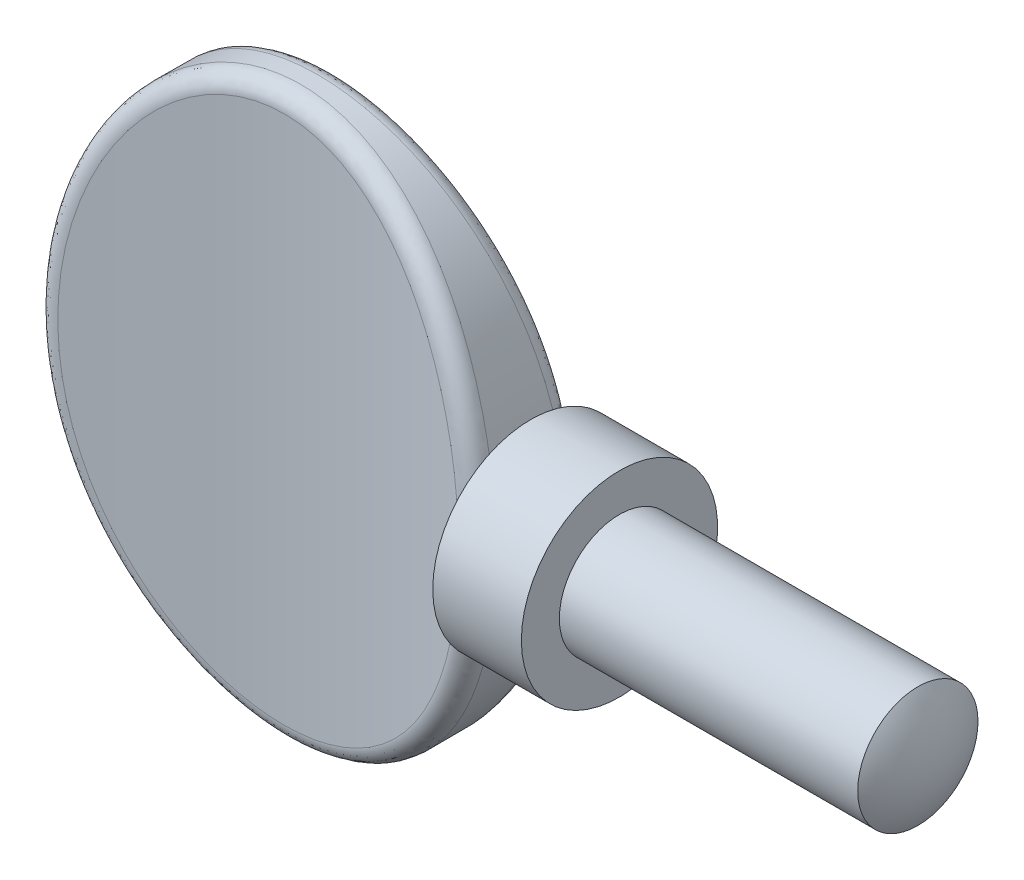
ISO-10303-21;
HEADER;
FILE_DESCRIPTION(('STEP AP214'),'2;1');
FILE_NAME('part.step','',(''),(''),'','','');
FILE_SCHEMA(('AUTOMOTIVE_DESIGN { 1 0 10303 214 1 1 1 1 }'));
ENDSEC;
DATA;
#1=APPLICATION_CONTEXT('core data for automotive mechanical design processes');
#2=APPLICATION_PROTOCOL_DEFINITION('international standard','automotive_design',2000,#1);
#3=PRODUCT_CONTEXT('',#1,'mechanical');
#4=PRODUCT('Part','Part','',(#3));
#5=PRODUCT_RELATED_PRODUCT_CATEGORY('part','',(#4));
#6=PRODUCT_DEFINITION_FORMATION('','',#4);
#7=PRODUCT_DEFINITION_CONTEXT('part definition',#1,'design');
#8=PRODUCT_DEFINITION('design','',#6,#7);
#9=PRODUCT_DEFINITION_SHAPE('','',#8);
#10=(LENGTH_UNIT() NAMED_UNIT(*) SI_UNIT(.MILLI.,.METRE.));
#11=(NAMED_UNIT(*) PLANE_ANGLE_UNIT() SI_UNIT($,.RADIAN.));
#12=(NAMED_UNIT(*) SI_UNIT($,.STERADIAN.) SOLID_ANGLE_UNIT());
#13=UNCERTAINTY_MEASURE_WITH_UNIT(LENGTH_MEASURE(1.E-05),#10,'distance_accuracy_value','');
#14=(GEOMETRIC_REPRESENTATION_CONTEXT(3) GLOBAL_UNCERTAINTY_ASSIGNED_CONTEXT((#13)) GLOBAL_UNIT_ASSIGNED_CONTEXT((#10,
#11,#12)) REPRESENTATION_CONTEXT('',''));
#15=CARTESIAN_POINT('',(0.,0.,0.));
#16=DIRECTION('',(0.,0.,1.));
#17=DIRECTION('',(1.,0.,0.));
#18=AXIS2_PLACEMENT_3D('',#15,#16,#17);
#19=CARTESIAN_POINT('',(0.,0.,2.286));
#20=DIRECTION('',(0.,0.,1.));
#21=DIRECTION('',(0.,1.,0.));
#22=AXIS2_PLACEMENT_3D('',#19,#20,#21);
#23=ELLIPSE('',#22,11.303,8.89);
#24=DIRECTION('',(0.,0.,-1.));
#25=VECTOR('',#24,1.);
#26=SURFACE_OF_LINEAR_EXTRUSION('',#23,#25);
#27=CARTESIAN_POINT('',(8.65241868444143,-2.59563035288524,1.41565744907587));
#28=CARTESIAN_POINT('',(8.64505380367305,-2.63527789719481,1.31316697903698));
#29=CARTESIAN_POINT('',(8.63830595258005,-2.67071705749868,1.20899028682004));
#30=CARTESIAN_POINT('',(8.62627848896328,-2.732857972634,0.99795411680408));
#31=CARTESIAN_POINT('',(8.6209992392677,-2.75955756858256,0.891093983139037));
#32=CARTESIAN_POINT('',(8.61214578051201,-2.8038850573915,0.675401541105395));
#33=CARTESIAN_POINT('',(8.60857205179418,-2.82151039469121,0.566568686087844));
#34=CARTESIAN_POINT('',(8.60328452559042,-2.84746342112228,0.347770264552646));
#35=CARTESIAN_POINT('',(8.60157044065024,-2.85579254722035,0.237804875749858));
#36=CARTESIAN_POINT('',(8.60008413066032,-2.86301911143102,0.0185388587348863));
#37=CARTESIAN_POINT('',(8.60029463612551,-2.86200042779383,-0.0907588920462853));
#38=CARTESIAN_POINT('',(8.60260692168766,-2.8507444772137,-0.308858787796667));
#39=CARTESIAN_POINT('',(8.60470870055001,-2.8405072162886,-0.417660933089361));
#40=CARTESIAN_POINT('',(8.61070632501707,-2.810972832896,-0.633744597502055));
#41=CARTESIAN_POINT('',(8.61459849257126,-2.79169428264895,-0.741028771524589));
#42=CARTESIAN_POINT('',(8.62400975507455,-2.74432029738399,-0.953510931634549));
#43=CARTESIAN_POINT('',(8.62952797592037,-2.71622959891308,-1.05871000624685));
#44=CARTESIAN_POINT('',(8.63844994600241,-2.66982167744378,-1.20771767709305));
#45=CARTESIAN_POINT('',(8.64128872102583,-2.65493954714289,-1.25265626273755));
#46=CARTESIAN_POINT('',(8.64720516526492,-2.62361466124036,-1.34191094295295));
#47=CARTESIAN_POINT('',(8.65028255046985,-2.60717375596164,-1.3862277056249));
#48=CARTESIAN_POINT('',(8.65346985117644,-2.58995946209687,-1.43023949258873));
#49=B_SPLINE_CURVE_WITH_KNOTS('',3,(#27,#28,#29,#30,#31,#32,#33,#34,#35,#36,#37,#38,#39,#40,#41,
#42,#43,#44,#45,#46,#47,#48),.UNSPECIFIED.,.F.,.F.,(4,2,2,2,2,2,2,2,2,2,4),(0.,
0.330340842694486,0.660763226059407,0.991278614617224,1.3217429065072,1.64924484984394,
1.97674657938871,2.30357849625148,2.63023504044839,2.772481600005,2.91456137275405),.UNSPECIFIED.);
#50=CARTESIAN_POINT('',(8.64686129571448,-2.62539678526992,1.33619092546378));
#51=VERTEX_POINT('',#50);
#52=CARTESIAN_POINT('',(8.64686129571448,-2.62539678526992,-1.33619092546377));
#53=VERTEX_POINT('',#52);
#54=EDGE_CURVE('E95',#51,#53,#49,.T.);
#55=ORIENTED_EDGE('',*,*,#54,.F.);
#56=CARTESIAN_POINT('',(7.82629564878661,2.43510426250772,1.99569619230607));
#57=CARTESIAN_POINT('',(8.6524513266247,2.59576258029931,2.20582536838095));
#58=CARTESIAN_POINT('',(8.65956685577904,2.55680519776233,1.3392630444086));
#59=CARTESIAN_POINT('',(7.94743912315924,1.75770532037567,2.02649942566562));
#60=CARTESIAN_POINT('',(8.78692406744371,1.87112905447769,2.24349586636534));
#61=CARTESIAN_POINT('',(8.78960914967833,1.84484328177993,1.37072341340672));
#62=CARTESIAN_POINT('',(8.01716971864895,1.07004055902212,2.04487170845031));
#63=CARTESIAN_POINT('',(8.86351312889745,1.14047337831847,2.26573738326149));
#64=CARTESIAN_POINT('',(8.86432478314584,1.12299912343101,1.38948763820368));
#65=CARTESIAN_POINT('',(8.0547289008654,-0.309351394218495,2.05469325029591));
#66=CARTESIAN_POINT('',(8.90506846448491,-0.330332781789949,2.27771295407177));
#67=CARTESIAN_POINT('',(8.90458477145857,-0.324674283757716,1.39951870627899));
#68=CARTESIAN_POINT('',(8.02243825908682,-1.00108239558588,2.04611100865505));
#69=CARTESIAN_POINT('',(8.86961883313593,-1.06541121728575,2.26732632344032));
#70=CARTESIAN_POINT('',(8.87000139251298,-1.05050720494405,1.39075337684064));
#71=CARTESIAN_POINT('',(7.89401839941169,-2.0534182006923,2.01297572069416));
#72=CARTESIAN_POINT('',(8.72737120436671,-2.18848798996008,2.22688533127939));
#73=CARTESIAN_POINT('',(8.73225170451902,-2.15566998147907,1.35691120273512));
#74=CARTESIAN_POINT('',(7.83428558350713,-2.41932216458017,1.99763575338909));
#75=CARTESIAN_POINT('',(8.66147254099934,-2.57804176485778,2.20823888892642));
#76=CARTESIAN_POINT('',(8.66816384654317,-2.54012241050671,1.34124398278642));
#77=CARTESIAN_POINT('',(7.68487396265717,-3.14447608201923,1.95997275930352));
#78=CARTESIAN_POINT('',(8.49634767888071,-3.35051128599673,2.16238668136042));
#79=CARTESIAN_POINT('',(8.50770464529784,-3.30263370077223,1.30277751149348));
#80=CARTESIAN_POINT('',(7.59519051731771,-3.50372499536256,1.93764865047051));
#81=CARTESIAN_POINT('',(8.39743269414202,-3.7327369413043,2.13526405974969));
#82=CARTESIAN_POINT('',(8.41132829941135,-3.68069156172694,1.27997715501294));
#83=CARTESIAN_POINT('',(7.38556781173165,-4.21216799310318,1.88675959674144));
#84=CARTESIAN_POINT('',(8.16589203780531,-4.48682518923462,2.07336294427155));
#85=CARTESIAN_POINT('',(8.18576943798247,-4.42707064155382,1.22800246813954));
#86=CARTESIAN_POINT('',(7.26565071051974,-4.56136923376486,1.8581992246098));
#87=CARTESIAN_POINT('',(8.03371748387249,-4.85809981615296,2.03869510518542));
#88=CARTESIAN_POINT('',(8.05661094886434,-4.79539877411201,1.19883280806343));
#89=CARTESIAN_POINT('',(6.99512443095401,-5.24646975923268,1.79585403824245));
#90=CARTESIAN_POINT('',(7.73510821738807,-5.58670082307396,1.96294144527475));
#91=CARTESIAN_POINT('',(7.76473855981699,-5.51911593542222,1.13515759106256));
#92=CARTESIAN_POINT('',(6.84452615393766,-5.58237371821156,1.76207108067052));
#93=CARTESIAN_POINT('',(7.56920233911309,-5.94356881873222,1.9219703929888));
#94=CARTESIAN_POINT('',(7.60203657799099,-5.87450950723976,1.10065393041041));
#95=CARTESIAN_POINT('',(6.43324199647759,-6.39240336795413,1.67357133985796));
#96=CARTESIAN_POINT('',(7.11651227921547,-6.80243787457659,1.81477728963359));
#97=CARTESIAN_POINT('',(7.15675138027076,-6.73320066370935,1.01026619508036));
#98=CARTESIAN_POINT('',(6.15417610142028,-6.85676635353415,1.61651047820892));
#99=CARTESIAN_POINT('',(6.8097291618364,-7.29531731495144,1.74570436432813));
#100=CARTESIAN_POINT('',(6.85386362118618,-7.22695535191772,0.951988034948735));
#101=CARTESIAN_POINT('',(5.52696453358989,-7.73305703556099,1.49913786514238));
#102=CARTESIAN_POINT('',(6.11796499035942,-8.22578037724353,1.60333969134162));
#103=CARTESIAN_POINT('',(6.17012522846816,-8.1622742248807,0.832111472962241));
#104=CARTESIAN_POINT('',(5.1789299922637,-8.1450673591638,1.43883145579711));
#105=CARTESIAN_POINT('',(5.73502064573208,-8.66343687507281,1.53025899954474));
#106=CARTESIAN_POINT('',(5.78939998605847,-8.60392057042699,0.770518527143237));
#107=CARTESIAN_POINT('',(4.49456535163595,-8.81832678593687,1.33426170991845));
#108=CARTESIAN_POINT('',(4.97849314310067,-9.3794545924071,1.4032069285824));
#109=CARTESIAN_POINT('',(5.03663111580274,-9.32899377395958,0.663717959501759));
#110=CARTESIAN_POINT('',(4.17119435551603,-9.09305461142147,1.28929359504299));
#111=CARTESIAN_POINT('',(4.62171828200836,-9.67163474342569,1.34859286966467));
#112=CARTESIAN_POINT('',(4.67963160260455,-9.62615608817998,0.617790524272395));
#113=CARTESIAN_POINT('',(3.65633336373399,-9.46244525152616,1.22675958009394));
#114=CARTESIAN_POINT('',(4.05119027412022,-10.0652330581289,1.27244557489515));
#115=CARTESIAN_POINT('',(4.10859190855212,-10.027291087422,0.553922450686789));
#116=CARTESIAN_POINT('',(3.47966977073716,-9.57849609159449,1.2067276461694));
#117=CARTESIAN_POINT('',(3.85593810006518,-10.1886210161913,1.24810451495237));
#118=CARTESIAN_POINT('',(3.91223716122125,-10.1536091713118,0.533463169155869));
#119=CARTESIAN_POINT('',(3.11708209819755,-9.79472651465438,1.16885648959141));
#120=CARTESIAN_POINT('',(3.45504248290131,-10.4184405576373,1.20209344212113));
#121=CARTESIAN_POINT('',(3.50833839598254,-10.3894449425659,0.494784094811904));
#122=CARTESIAN_POINT('',(2.93116240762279,-9.89491352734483,1.15101624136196));
#123=CARTESIAN_POINT('',(3.24936320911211,-10.5250344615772,1.18039540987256));
#124=CARTESIAN_POINT('',(3.30079967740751,-10.4989704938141,0.476563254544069));
#125=CARTESIAN_POINT('',(2.54905941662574,-10.0787208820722,1.1179046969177));
#126=CARTESIAN_POINT('',(2.82653251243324,-10.7204996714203,1.14013561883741));
#127=CARTESIAN_POINT('',(2.87336447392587,-10.7002891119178,0.442745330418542));
#128=CARTESIAN_POINT('',(2.35279103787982,-10.162162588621,1.10266133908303));
#129=CARTESIAN_POINT('',(2.60916890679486,-10.8093536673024,1.12157484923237));
#130=CARTESIAN_POINT('',(2.65336386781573,-10.7918907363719,0.427176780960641));
#131=CARTESIAN_POINT('',(1.953218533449,-10.3095327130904,1.07550466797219));
#132=CARTESIAN_POINT('',(2.16659574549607,-10.9661742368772,1.08852563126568));
#133=CARTESIAN_POINT('',(2.20463537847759,-10.953933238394,0.399440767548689));
#134=CARTESIAN_POINT('',(1.74991833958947,-10.3734718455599,1.06358952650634));
#135=CARTESIAN_POINT('',(1.94121514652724,-11.0343149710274,1.07400206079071));
#136=CARTESIAN_POINT('',(1.9759123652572,-11.0243857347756,0.387271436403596));
#137=CARTESIAN_POINT('',(1.33807057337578,-10.4804542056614,1.04353897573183));
#138=CARTESIAN_POINT('',(1.48468245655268,-11.1482227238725,1.04958182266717));
#139=CARTESIAN_POINT('',(1.51188091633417,-11.1424052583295,0.36679314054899));
#140=CARTESIAN_POINT('',(1.12952697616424,-10.5235127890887,1.03540078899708));
#141=CARTESIAN_POINT('',(1.25329276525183,-11.194142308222,1.03965311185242));
#142=CARTESIAN_POINT('',(1.27657745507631,-11.1899891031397,0.358481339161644));
#143=CARTESIAN_POINT('',(0.709126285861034,-10.5877622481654,1.02322405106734));
#144=CARTESIAN_POINT('',(0.787001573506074,-11.2625799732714,1.02481403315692));
#145=CARTESIAN_POINT('',(0.801790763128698,-11.2610341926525,0.346044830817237));
#146=CARTESIAN_POINT('',(0.497269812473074,-10.6089571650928,1.01918474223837));
#147=CARTESIAN_POINT('',(0.551805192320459,-11.2851925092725,1.01988330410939));
#148=CARTESIAN_POINT('',(0.562308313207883,-11.2844998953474,0.341919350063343));
#149=CARTESIAN_POINT('',(0.105050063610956,-10.627432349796,1.01566371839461));
#150=CARTESIAN_POINT('',(0.116614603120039,-11.3048795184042,1.01559044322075));
#151=CARTESIAN_POINT('',(0.118812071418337,-11.304954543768,0.338323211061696));
#152=CARTESIAN_POINT('',(-0.0751715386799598,-10.6278758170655,1.0155791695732));
#153=CARTESIAN_POINT('',(-0.0834564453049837,-11.3053519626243,1.01548738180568));
#154=CARTESIAN_POINT('',(-0.0850214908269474,-11.3054455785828,0.338236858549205));
#155=CARTESIAN_POINT('',(-0.434937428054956,-10.6127090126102,1.01846977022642));
#156=CARTESIAN_POINT('',(-0.482622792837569,-11.2891920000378,1.01901126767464));
#157=CARTESIAN_POINT('',(-0.491831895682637,-11.2886536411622,0.341189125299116));
#158=CARTESIAN_POINT('',(-0.614481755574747,-10.5970997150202,1.02144473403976));
#159=CARTESIAN_POINT('',(-0.681915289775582,-11.2725446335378,1.0226414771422));
#160=CARTESIAN_POINT('',(-0.694808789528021,-11.2713717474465,0.344227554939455));
#161=CARTESIAN_POINT('',(-0.971475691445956,-10.5501136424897,1.03036356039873));
#162=CARTESIAN_POINT('',(-1.07791350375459,-11.2224918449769,1.03351143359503));
#163=CARTESIAN_POINT('',(-1.0981231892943,-11.2193981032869,0.353336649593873));
#164=CARTESIAN_POINT('',(-1.14892554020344,-10.5187386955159,1.03630707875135));
#165=CARTESIAN_POINT('',(-1.27480360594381,-11.1890405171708,1.04076111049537));
#166=CARTESIAN_POINT('',(-1.29846099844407,-11.1847083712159,0.359406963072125));
#167=CARTESIAN_POINT('',(-1.50046734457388,-10.4407724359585,1.05098693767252));
#168=CARTESIAN_POINT('',(-1.66458038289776,-11.1060123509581,1.05864455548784));
#169=CARTESIAN_POINT('',(-1.69492269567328,-11.0986163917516,0.37439999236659));
#170=CARTESIAN_POINT('',(-1.67455920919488,-10.3941807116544,1.05972335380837));
#171=CARTESIAN_POINT('',(-1.85762658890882,-11.0563611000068,1.06929413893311));
#172=CARTESIAN_POINT('',(-1.89104646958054,-11.0472136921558,0.383322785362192));
#173=CARTESIAN_POINT('',(-2.01159554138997,-10.2886238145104,1.07935663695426));
#174=CARTESIAN_POINT('',(-2.23106714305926,-10.9440082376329,1.0931959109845));
#175=CARTESIAN_POINT('',(-2.27021161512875,-10.9309431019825,0.403374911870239));
#176=CARTESIAN_POINT('',(-2.17471076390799,-10.2302066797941,1.0901569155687));
#177=CARTESIAN_POINT('',(-2.41179975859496,-10.8817955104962,1.10635018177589));
#178=CARTESIAN_POINT('',(-2.45346562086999,-10.8666726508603,0.414405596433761));
#179=CARTESIAN_POINT('',(-2.49596337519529,-10.1008201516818,1.11384924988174));
#180=CARTESIAN_POINT('',(-2.76753136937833,-10.7441371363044,1.13517612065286));
#181=CARTESIAN_POINT('',(-2.81382794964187,-10.7245661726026,0.438603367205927));
#182=CARTESIAN_POINT('',(-2.65409915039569,-10.0298467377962,1.12674197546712));
#183=CARTESIAN_POINT('',(-2.94261127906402,-10.6685976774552,1.15086640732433));
#184=CARTESIAN_POINT('',(-2.99093428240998,-10.6467258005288,0.451771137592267));
#185=CARTESIAN_POINT('',(-3.11989632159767,-9.79942559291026,1.16812424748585));
#186=CARTESIAN_POINT('',(-3.45909560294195,-10.4230523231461,1.20128501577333));
#187=CARTESIAN_POINT('',(-3.51173172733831,-10.3944780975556,0.494036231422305));
#188=CARTESIAN_POINT('',(-3.41911154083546,-9.62242439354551,1.19932790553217));
#189=CARTESIAN_POINT('',(-3.79004687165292,-10.2345494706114,1.23926399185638));
#190=CARTESIAN_POINT('',(-3.84508579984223,-10.20128606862,0.525905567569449));
#191=CARTESIAN_POINT('',(-4.09904643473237,-9.15457953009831,1.27920788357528));
#192=CARTESIAN_POINT('',(-4.54276316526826,-9.73660029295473,1.33643019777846));
#193=CARTESIAN_POINT('',(-4.59999386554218,-9.69271674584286,0.607489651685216));
#194=CARTESIAN_POINT('',(-4.4677733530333,-8.84600074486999,1.3300283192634));
#195=CARTESIAN_POINT('',(-4.94952770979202,-9.40827652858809,1.39816929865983));
#196=CARTESIAN_POINT('',(-5.00720170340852,-9.35876546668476,0.659394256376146));
#197=CARTESIAN_POINT('',(-5.1506512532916,-8.17151649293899,1.43465606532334));
#198=CARTESIAN_POINT('',(-5.70311367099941,-8.69214633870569,1.52508390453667));
#199=CARTESIAN_POINT('',(-5.75825220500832,-8.6324387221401,0.766254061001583));
#200=CARTESIAN_POINT('',(-5.46469809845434,-7.80550411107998,1.48846882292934));
#201=CARTESIAN_POINT('',(-6.04883115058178,-8.30338280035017,1.59030661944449));
#202=CARTESIAN_POINT('',(-6.10197403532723,-8.23995436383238,0.821214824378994));
#203=CARTESIAN_POINT('',(-6.1153233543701,-6.92506403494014,1.60828795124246));
#204=CARTESIAN_POINT('',(-6.76780893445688,-7.36679603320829,1.73590034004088));
#205=CARTESIAN_POINT('',(-6.81177427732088,-7.29951289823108,0.943590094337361));
#206=CARTESIAN_POINT('',(-6.43476934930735,-6.39735552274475,1.67362664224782));
#207=CARTESIAN_POINT('',(-7.11866978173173,-6.80670608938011,1.81495566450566));
#208=CARTESIAN_POINT('',(-7.15847428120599,-6.73831516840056,1.010322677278));
#209=CARTESIAN_POINT('',(-6.98586982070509,-5.29504721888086,1.79279155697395));
#210=CARTESIAN_POINT('',(-7.72672939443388,-5.63515267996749,1.95964859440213));
#211=CARTESIAN_POINT('',(-7.75498793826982,-5.57007516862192,1.1320297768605));
#212=CARTESIAN_POINT('',(-7.21743550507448,-4.72040071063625,1.84660611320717));
#213=CARTESIAN_POINT('',(-7.98107986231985,-5.02517153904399,2.02476167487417));
#214=CARTESIAN_POINT('',(-8.00470360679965,-4.96298727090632,1.1869923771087));
#215=CARTESIAN_POINT('',(-7.59788704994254,-3.53286241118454,1.93787390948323));
#216=CARTESIAN_POINT('',(-8.40127783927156,-3.76125290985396,2.13576419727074));
#217=CARTESIAN_POINT('',(-8.41432758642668,-3.71108875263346,1.28020721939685));
#218=CARTESIAN_POINT('',(-7.74551320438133,-2.91953395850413,1.97507615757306));
#219=CARTESIAN_POINT('',(-8.56353360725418,-3.10968614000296,2.18081781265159));
#220=CARTESIAN_POINT('',(-8.57286798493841,-3.06585606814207,1.31820311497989));
#221=CARTESIAN_POINT('',(-7.95444111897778,-1.67779030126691,2.02838222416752));
#222=CARTESIAN_POINT('',(-8.79452477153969,-1.7865113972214,2.24575202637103));
#223=CARTESIAN_POINT('',(-8.79710310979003,-1.76097068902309,1.37264637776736));
#224=CARTESIAN_POINT('',(-8.01589074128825,-1.04940282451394,2.04452217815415));
#225=CARTESIAN_POINT('',(-8.86213168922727,-1.11847428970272,2.26532120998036));
#226=CARTESIAN_POINT('',(-8.8629568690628,-1.10134467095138,1.38913065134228));
#227=CARTESIAN_POINT('',(-8.04339962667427,-0.134428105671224,2.05173737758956));
#228=CARTESIAN_POINT('',(-8.8925087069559,-0.143244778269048,2.27410147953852));
#229=CARTESIAN_POINT('',(-8.89243947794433,-0.141070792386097,1.39649977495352));
#230=CARTESIAN_POINT('',(-8.04322422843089,0.151433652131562,2.0516867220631));
#231=CARTESIAN_POINT('',(-8.8923243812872,0.161377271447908,2.27404244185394));
#232=CARTESIAN_POINT('',(-8.89225248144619,0.158917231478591,1.39644803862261));
#233=CARTESIAN_POINT('',(-8.02535656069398,0.722706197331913,2.04701032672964));
#234=CARTESIAN_POINT('',(-8.87256700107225,0.770474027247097,2.26834414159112));
#235=CARTESIAN_POINT('',(-8.8731007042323,0.75847481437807,1.39167188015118));
#236=CARTESIAN_POINT('',(-8.00765727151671,1.00811675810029,2.04238275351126));
#237=CARTESIAN_POINT('',(-8.85300951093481,1.07458955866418,2.26270936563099));
#238=CARTESIAN_POINT('',(-8.85412839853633,1.05804415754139,1.3869455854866));
#239=CARTESIAN_POINT('',(-7.94788667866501,1.65005580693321,2.02685880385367));
#240=CARTESIAN_POINT('',(-8.78692419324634,1.75875334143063,2.24379627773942));
#241=CARTESIAN_POINT('',(-8.79003704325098,1.73201243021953,1.37109045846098));
#242=CARTESIAN_POINT('',(-7.90073256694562,2.00606858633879,2.01465999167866));
#243=CARTESIAN_POINT('',(-8.73487578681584,2.13786228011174,2.22895949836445));
#244=CARTESIAN_POINT('',(-8.73946402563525,2.10591711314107,1.35863140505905));
#245=CARTESIAN_POINT('',(-7.77848949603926,2.71274841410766,1.98351195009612));
#246=CARTESIAN_POINT('',(-8.59973851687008,2.89083812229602,2.19102428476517));
#247=CARTESIAN_POINT('',(-8.60825500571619,2.84858479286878,1.3268188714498));
#248=CARTESIAN_POINT('',(-7.70339994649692,3.063415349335,1.9645625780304));
#249=CARTESIAN_POINT('',(-8.51689426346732,3.26405432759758,2.16799271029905));
#250=CARTESIAN_POINT('',(-8.52761836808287,3.21734768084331,1.30746524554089));
#251=CARTESIAN_POINT('',(-7.52482874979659,3.75734261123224,1.92045005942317));
#252=CARTESIAN_POINT('',(-8.31960205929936,4.00293869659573,2.11431336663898));
#253=CARTESIAN_POINT('',(-8.33564394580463,3.94777946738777,1.26241165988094));
#254=CARTESIAN_POINT('',(-7.42130346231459,4.10059067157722,1.89527736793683));
#255=CARTESIAN_POINT('',(-8.20545267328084,4.36801638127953,2.08374271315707));
#256=CARTESIAN_POINT('',(-8.22425897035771,4.30943653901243,1.23670195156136));
#257=CARTESIAN_POINT('',(-7.18557888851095,4.77601163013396,1.83956259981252));
#258=CARTESIAN_POINT('',(-7.94517850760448,5.08660176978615,2.01601312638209));
#259=CARTESIAN_POINT('',(-7.97026371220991,5.02200340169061,1.17979860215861));
#260=CARTESIAN_POINT('',(-7.05338947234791,5.10818829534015,1.8090223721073));
#261=CARTESIAN_POINT('',(-7.79950129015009,5.43963428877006,1.97895746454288));
#262=CARTESIAN_POINT('',(-7.8276641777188,5.37291684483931,1.14860684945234));
#263=CARTESIAN_POINT('',(-6.67495246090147,5.94632514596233,1.72466643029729));
#264=CARTESIAN_POINT('',(-7.38297359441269,6.32842399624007,1.87676435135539));
#265=CARTESIAN_POINT('',(-7.41867402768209,6.25981775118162,1.06245131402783));
#266=CARTESIAN_POINT('',(-6.40690462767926,6.44195824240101,1.66758899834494));
#267=CARTESIAN_POINT('',(-7.08838989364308,6.85447080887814,1.80768456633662));
#268=CARTESIAN_POINT('',(-7.12833321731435,6.7857542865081,1.00415623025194));
#269=CARTESIAN_POINT('',(-5.79654461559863,7.38178409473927,1.54807423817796));
#270=CARTESIAN_POINT('',(-6.41517877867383,7.85259495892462,1.66268974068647));
#271=CARTESIAN_POINT('',(-6.46441231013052,7.78670698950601,0.882091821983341));
#272=CARTESIAN_POINT('',(-5.45436166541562,7.82606432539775,1.48564634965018));
#273=CARTESIAN_POINT('',(-6.03887887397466,8.32439730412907,1.58707563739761));
#274=CARTESIAN_POINT('',(-6.09097702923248,8.26180964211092,0.818332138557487));
#275=CARTESIAN_POINT('',(-4.77789167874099,8.55448470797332,1.37612062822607));
#276=CARTESIAN_POINT('',(-5.29119543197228,9.09910698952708,1.45400801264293));
#277=CARTESIAN_POINT('',(-5.34869298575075,9.04439141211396,0.70646986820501));
#278=CARTESIAN_POINT('',(-4.45799420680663,8.85245688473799,1.32863499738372));
#279=CARTESIAN_POINT('',(-4.93851328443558,9.41585809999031,1.39637707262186));
#280=CARTESIAN_POINT('',(-4.99642235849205,9.36587548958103,0.657971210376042));
#281=CARTESIAN_POINT('',(-3.77461012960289,9.39190551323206,1.23929408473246));
#282=CARTESIAN_POINT('',(-4.18378611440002,9.98880971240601,1.28794469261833));
#283=CARTESIAN_POINT('',(-4.24030383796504,9.95027102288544,0.566724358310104));
#284=CARTESIAN_POINT('',(-3.41117328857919,9.63344555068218,1.19743248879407));
#285=CARTESIAN_POINT('',(-3.78213052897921,10.2460992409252,1.23700255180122));
#286=CARTESIAN_POINT('',(-3.83651479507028,10.2132483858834,0.523969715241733));
#287=CARTESIAN_POINT('',(-2.7071131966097,10.0130852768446,1.12997552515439));
#288=CARTESIAN_POINT('',(-3.00265612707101,10.6500345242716,1.15495053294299));
#289=CARTESIAN_POINT('',(-3.05059237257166,10.6281650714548,0.45507366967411));
#290=CARTESIAN_POINT('',(-2.37204630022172,10.1615243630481,1.10285226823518));
#291=CARTESIAN_POINT('',(-2.63139042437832,10.8083853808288,1.12186903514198));
#292=CARTESIAN_POINT('',(-2.6752189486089,10.7911098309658,0.427371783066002));
#293=CARTESIAN_POINT('',(-1.85473120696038,10.3404490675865,1.06974582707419));
#294=CARTESIAN_POINT('',(-2.05733540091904,10.9991414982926,1.08150227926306));
#295=CARTESIAN_POINT('',(-2.0938367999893,10.9879949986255,0.3935590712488));
#296=CARTESIAN_POINT('',(-1.67979337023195,10.3928095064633,1.05997187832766));
#297=CARTESIAN_POINT('',(-1.86339026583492,11.0549303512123,1.06959065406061));
#298=CARTESIAN_POINT('',(-1.89693593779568,11.045710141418,0.383576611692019));
#299=CARTESIAN_POINT('',(-1.32608818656,10.4821521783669,1.04321230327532));
#300=CARTESIAN_POINT('',(-1.47128411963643,11.1500600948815,1.0491774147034));
#301=CARTESIAN_POINT('',(-1.49833774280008,11.1442889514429,0.36645949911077));
#302=CARTESIAN_POINT('',(-1.14732240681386,10.5191405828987,1.03622555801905));
#303=CARTESIAN_POINT('',(-1.27297000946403,11.1894916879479,1.04065670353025));
#304=CARTESIAN_POINT('',(-1.29664236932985,11.1851593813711,0.35932370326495));
#305=CARTESIAN_POINT('',(-0.786475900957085,10.5772111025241,1.02522674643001));
#306=CARTESIAN_POINT('',(-0.872750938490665,11.2513466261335,1.02725345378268));
#307=CARTESIAN_POINT('',(-0.889172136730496,11.2493631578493,0.348090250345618));
#308=CARTESIAN_POINT('',(-0.604384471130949,10.5982263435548,1.02122718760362));
#309=CARTESIAN_POINT('',(-0.670646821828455,11.2737587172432,1.02237324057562));
#310=CARTESIAN_POINT('',(-0.683383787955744,11.2726227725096,0.344005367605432));
#311=CARTESIAN_POINT('',(-0.239046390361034,10.6237097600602,1.01637444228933));
#312=CARTESIAN_POINT('',(-0.265317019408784,11.3009091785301,1.01645776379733));
#313=CARTESIAN_POINT('',(-0.270347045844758,11.3008314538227,0.33904909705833));
#314=CARTESIAN_POINT('',(-0.0557997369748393,10.6281779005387,1.01552126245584));
#315=CARTESIAN_POINT('',(-0.0618866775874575,11.3056751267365,1.01541649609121));
#316=CARTESIAN_POINT('',(-0.0630986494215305,11.3057804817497,0.338177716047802));
#317=CARTESIAN_POINT('',(0.310342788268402,10.6204795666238,1.01698891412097));
#318=CARTESIAN_POINT('',(0.344362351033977,11.2974728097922,1.01720566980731));
#319=CARTESIAN_POINT('',(0.35095451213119,11.2972566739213,0.339676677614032));
#320=CARTESIAN_POINT('',(0.493238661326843,10.6083131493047,1.0193097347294));
#321=CARTESIAN_POINT('',(0.547389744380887,11.2844961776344,1.02003793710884));
#322=CARTESIAN_POINT('',(0.557759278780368,11.2837839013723,0.342047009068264));
#323=CARTESIAN_POINT('',(0.857193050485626,10.5675786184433,1.02705146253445));
#324=CARTESIAN_POINT('',(0.951137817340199,11.2411005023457,1.02947400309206));
#325=CARTESIAN_POINT('',(0.969049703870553,11.2387130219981,0.349953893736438));
#326=CARTESIAN_POINT('',(1.03825162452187,10.5390110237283,1.03247227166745));
#327=CARTESIAN_POINT('',(1.15205642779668,11.2106386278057,1.0360870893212));
#328=CARTESIAN_POINT('',(1.1735354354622,11.2071154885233,0.355490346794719));
#329=CARTESIAN_POINT('',(1.38577241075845,10.4683102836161,1.04581044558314));
#330=CARTESIAN_POINT('',(1.53738746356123,11.1353476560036,1.05233647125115));
#331=CARTESIAN_POINT('',(1.56562555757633,11.1290138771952,0.369113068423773));
#332=CARTESIAN_POINT('',(1.55243251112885,10.4271514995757,1.0535478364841));
#333=CARTESIAN_POINT('',(1.72221209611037,11.0914846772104,1.06176887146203));
#334=CARTESIAN_POINT('',(1.75347855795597,11.0835813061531,0.377015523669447));
#335=CARTESIAN_POINT('',(1.88194456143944,10.3315323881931,1.07139376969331));
#336=CARTESIAN_POINT('',(2.08740434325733,10.9896901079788,1.08349994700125));
#337=CARTESIAN_POINT('',(2.12443081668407,10.9781855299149,0.395242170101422));
#338=CARTESIAN_POINT('',(2.0447952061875,10.2770675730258,1.08150311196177));
#339=CARTESIAN_POINT('',(2.26788778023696,10.9316775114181,1.09581547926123));
#340=CARTESIAN_POINT('',(2.30752844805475,10.9182174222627,0.405567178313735));
#341=CARTESIAN_POINT('',(2.52615676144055,10.0948432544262,1.11502540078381));
#342=CARTESIAN_POINT('',(2.80192013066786,10.737438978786,1.13667911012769));
#343=CARTESIAN_POINT('',(2.84792805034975,10.7179160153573,0.439804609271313));
#344=CARTESIAN_POINT('',(2.83775186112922,9.94819639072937,1.14164376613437));
#345=CARTESIAN_POINT('',(3.14702031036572,10.5810992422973,1.16912176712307));
#346=CARTESIAN_POINT('',(3.19664674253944,10.5571217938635,0.466990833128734));
#347=CARTESIAN_POINT('',(3.46147687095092,9.59774159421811,1.20356654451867));
#348=CARTESIAN_POINT('',(3.83708974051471,10.208437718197,1.24439518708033));
#349=CARTESIAN_POINT('',(3.8923162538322,10.1744153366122,0.530234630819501));
#350=CARTESIAN_POINT('',(3.77151791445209,9.3902081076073,1.23940741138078));
#351=CARTESIAN_POINT('',(4.17970555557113,9.98753738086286,1.28798248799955));
#352=CARTESIAN_POINT('',(4.23673354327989,9.94854700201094,0.566840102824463));
#353=CARTESIAN_POINT('',(4.35991988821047,8.93336469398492,1.3153767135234));
#354=CARTESIAN_POINT('',(4.82954880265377,9.50230750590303,1.38018944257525));
#355=CARTESIAN_POINT('',(4.88803612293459,9.45342711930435,0.644430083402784));
#356=CARTESIAN_POINT('',(4.63825599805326,8.68402240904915,1.35550846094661));
#357=CARTESIAN_POINT('',(5.1365679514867,9.23728381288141,1.42890183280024));
#358=CARTESIAN_POINT('',(5.19489202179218,9.18414197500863,0.685417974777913));
#359=CARTESIAN_POINT('',(5.2883525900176,8.02265329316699,1.45704370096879));
#360=CARTESIAN_POINT('',(5.85585474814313,8.53323619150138,1.55237909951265));
#361=CARTESIAN_POINT('',(5.90931964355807,8.47252416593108,0.789119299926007));
#362=CARTESIAN_POINT('',(5.64019381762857,7.59026791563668,1.51934813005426));
#363=CARTESIAN_POINT('',(6.24288672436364,8.07397250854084,1.6278673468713));
#364=CARTESIAN_POINT('',(6.29382777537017,8.00948569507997,0.852752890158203));
#365=CARTESIAN_POINT('',(6.27033111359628,6.6722554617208,1.63966575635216));
#366=CARTESIAN_POINT('',(6.93790446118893,7.09909556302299,1.77382186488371));
#367=CARTESIAN_POINT('',(6.98009678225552,7.03057005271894,0.975637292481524));
#368=CARTESIAN_POINT('',(6.54850581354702,6.18654236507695,1.69767175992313));
#369=CARTESIAN_POINT('',(7.24361717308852,6.58356877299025,1.84402554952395));
#370=CARTESIAN_POINT('',(7.28172113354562,6.51460760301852,1.03488075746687));
#371=CARTESIAN_POINT('',(7.03636802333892,5.17052156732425,1.80448690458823));
#372=CARTESIAN_POINT('',(7.78195651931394,5.50356359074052,1.97373871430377));
#373=CARTESIAN_POINT('',(7.80945284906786,5.43850602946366,1.14397462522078));
#374=CARTESIAN_POINT('',(7.2449545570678,4.63964991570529,1.85314346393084));
#375=CARTESIAN_POINT('',(8.01126147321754,4.93984669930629,2.03265655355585));
#376=CARTESIAN_POINT('',(8.03434739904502,4.87781622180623,1.19366919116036));
#377=CARTESIAN_POINT('',(7.58960073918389,3.55324278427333,1.93595435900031));
#378=CARTESIAN_POINT('',(8.39188677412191,3.78362130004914,2.13336693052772));
#379=CARTESIAN_POINT('',(8.40539047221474,3.73262048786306,1.27824671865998));
#380=CARTESIAN_POINT('',(7.72568060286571,2.99771422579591,1.97011273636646));
#381=CARTESIAN_POINT('',(8.54157946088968,3.19321802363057,2.17476629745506));
#382=CARTESIAN_POINT('',(8.55156094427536,3.14812124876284,1.31313380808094));
#383=CARTESIAN_POINT('',(7.82629564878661,2.43510426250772,1.99569619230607));
#384=CARTESIAN_POINT('',(8.6524513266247,2.59576258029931,2.20582536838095));
#385=CARTESIAN_POINT('',(8.65956685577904,2.55680519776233,1.3392630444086));
#386=(BOUNDED_SURFACE() B_SPLINE_SURFACE(3,2,((#56,#57,#58),(#59,#60,#61),(#62,#63,#64),(#65,
#66,#67),(#68,#69,#70),(#71,#72,#73),(#74,#75,#76),(#77,#78,#79),(#80,#81,#82),(#83,#84,#85),
(#86,#87,#88),(#89,#90,#91),(#92,#93,#94),(#95,#96,#97),(#98,#99,#100),(#101,#102,#103),(#104,
#105,#106),(#107,#108,#109),(#110,#111,#112),(#113,#114,#115),(#116,#117,#118),(#119,#120,#121),
(#122,#123,#124),(#125,#126,#127),(#128,#129,#130),(#131,#132,#133),(#134,#135,#136),(#137,#138,
#139),(#140,#141,#142),(#143,#144,#145),(#146,#147,#148),(#149,#150,#151),(#152,#153,#154),
(#155,#156,#157),(#158,#159,#160),(#161,#162,#163),(#164,#165,#166),(#167,#168,#169),(#170,#171,
#172),(#173,#174,#175),(#176,#177,#178),(#179,#180,#181),(#182,#183,#184),(#185,#186,#187),
(#188,#189,#190),(#191,#192,#193),(#194,#195,#196),(#197,#198,#199),(#200,#201,#202),(#203,#204,
#205),(#206,#207,#208),(#209,#210,#211),(#212,#213,#214),(#215,#216,#217),(#218,#219,#220),
(#221,#222,#223),(#224,#225,#226),(#227,#228,#229),(#230,#231,#232),(#233,#234,#235),(#236,#237,
#238),(#239,#240,#241),(#242,#243,#244),(#245,#246,#247),(#248,#249,#250),(#251,#252,#253),
(#254,#255,#256),(#257,#258,#259),(#260,#261,#262),(#263,#264,#265),(#266,#267,#268),(#269,#270,
#271),(#272,#273,#274),(#275,#276,#277),(#278,#279,#280),(#281,#282,#283),(#284,#285,#286),
(#287,#288,#289),(#290,#291,#292),(#293,#294,#295),(#296,#297,#298),(#299,#300,#301),(#302,#303,
#304),(#305,#306,#307),(#308,#309,#310),(#311,#312,#313),(#314,#315,#316),(#317,#318,#319),
(#320,#321,#322),(#323,#324,#325),(#326,#327,#328),(#329,#330,#331),(#332,#333,#334),(#335,#336,
#337),(#338,#339,#340),(#341,#342,#343),(#344,#345,#346),(#347,#348,#349),(#350,#351,#352),
(#353,#354,#355),(#356,#357,#358),(#359,#360,#361),(#362,#363,#364),(#365,#366,#367),(#368,#369,
#370),(#371,#372,#373),(#374,#375,#376),(#377,#378,#379),(#380,#381,#382),(#383,#384,#385)),
.UNSPECIFIED.,.T.,.F.,.F.) B_SPLINE_SURFACE_WITH_KNOTS((4,2,2,2,2,2,2,2,2,2,2,2,2,2,2,2,2,2,2,2,
2,2,2,2,2,2,2,2,2,2,2,2,2,2,2,2,2,2,2,2,2,2,2,2,2,2,2,2,2,2,2,2,2,2,4),(3,3),(0.,
2.06622314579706,4.13486190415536,5.24755247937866,6.36041552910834,7.47246529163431,
8.58412061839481,10.2215277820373,11.8563176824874,13.1469674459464,13.792803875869,
14.4383369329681,15.0904277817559,15.7421597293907,16.3934116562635,17.0445431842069,
17.5960362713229,18.1474958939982,18.6988915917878,19.2503022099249,19.7803937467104,
20.3106553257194,21.3706565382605,22.831692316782,24.295480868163,26.157681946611,
28.0217595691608,29.9131198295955,31.8012308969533,32.6583453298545,33.5158032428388,
34.5929671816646,35.6701538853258,36.7490030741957,37.8274813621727,39.5282876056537,
41.226152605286,42.5557025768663,43.883747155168,45.0006946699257,45.5594567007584,
46.1179941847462,46.6788573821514,47.2397217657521,47.8005842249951,48.3614289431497,
48.8867331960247,49.4122148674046,50.4623283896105,51.5993275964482,52.7372108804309,
54.4254075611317,56.116368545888,57.8329376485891,59.5490279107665),(0.,1.),
.UNSPECIFIED.) GEOMETRIC_REPRESENTATION_ITEM() RATIONAL_B_SPLINE_SURFACE(((1.,0.615432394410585,
1.),(1.,0.612974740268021,1.),(1.,0.611532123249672,1.),(1.,0.610758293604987,1.),(1.,
0.611429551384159,1.),(1.,0.614055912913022,1.),(1.,0.615274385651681,1.),(1.,0.618290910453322,
1.),(1.,0.620089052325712,1.),(1.,0.62423313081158,1.),(1.,0.626578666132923,1.),(1.,
0.631770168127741,1.),(1.,0.63461595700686,1.),(1.,0.642197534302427,1.),(1.,0.647190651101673,
1.),(1.,0.657791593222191,1.),(1.,0.663398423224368,1.),(1.,0.673468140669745,1.),(1.,
0.677923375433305,1.),(1.,0.684287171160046,1.),(1.,0.686356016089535,1.),(1.,0.690317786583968,
1.),(1.,0.692210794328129,1.),(1.,0.695765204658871,1.),(1.,0.697424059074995,1.),(1.,
0.700407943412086,1.),(1.,0.701733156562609,1.),(1.,0.703978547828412,1.),(1.,0.704899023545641,
1.),(1.,0.706281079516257,1.),(1.,0.706742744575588,1.),(1.,0.707145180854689,1.),(1.,
0.707154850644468,1.),(1.,0.706824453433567,1.),(1.,0.70648440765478,1.),(1.,0.705470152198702,
1.),(1.,0.70479598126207,1.),(1.,0.703143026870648,1.),(1.,0.702164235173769,1.),(1.,
0.69998473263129,1.),(1.,0.698794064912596,1.),(1.,0.696208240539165,1.),(1.,0.694813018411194,
1.),(1.,0.690384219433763,1.),(1.,0.687106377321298,1.),(1.,0.678923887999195,1.),(1.,
0.673872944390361,1.),(1.,0.663803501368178,1.),(1.,0.658785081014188,1.),(1.,0.64790425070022,
1.),(1.,0.642183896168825,1.),(1.,0.631994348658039,1.),(1.,0.627526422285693,1.),(1.,
0.620055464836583,1.),(1.,0.617074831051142,1.),(1.,0.612828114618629,1.),(1.,0.61155909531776,
1.),(1.,0.6109914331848,1.),(1.,0.610995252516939,1.),(1.,0.61136353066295,1.),(1.,
0.611728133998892,1.),(1.,0.612954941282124,1.),(1.,0.613920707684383,1.),(1.,0.616403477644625,
1.),(1.,0.617920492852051,1.),(1.,0.621485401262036,1.),(1.,0.623534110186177,1.),(1.,
0.628123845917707,1.),(1.,0.630664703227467,1.),(1.,0.637788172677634,1.),(1.,0.642702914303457,
1.),(1.,0.653321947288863,1.),(1.,0.659024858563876,1.),(1.,0.669395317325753,1.),(1.,
0.674019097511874,1.),(1.,0.682970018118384,1.),(1.,0.687297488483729,1.),(1.,0.69444459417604,
1.),(1.,0.697394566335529,1.),(1.,0.701047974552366,1.),(1.,0.702137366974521,1.),(1.,
0.704016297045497,1.),(1.,0.704805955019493,1.),(1.,0.706053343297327,1.),(1.,0.70650967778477,
1.),(1.,0.707063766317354,1.),(1.,0.707161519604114,1.),(1.,0.70699370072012,1.),(1.,
0.706728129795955,1.),(1.,0.705846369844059,1.),(1.,0.705230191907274,1.),(1.,0.703724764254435,
1.),(1.,0.702855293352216,1.),(1.,0.700866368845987,1.),(1.,0.699746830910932,1.),(1.,
0.696070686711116,1.),(1.,0.693195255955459,1.),(1.,0.686667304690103,1.),(1.,0.682970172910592,
1.),(1.,0.675337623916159,1.),(1.,0.671402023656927,1.),(1.,0.661686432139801,1.),(1.,
0.655934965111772,1.),(1.,0.6451453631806,1.),(1.,0.640108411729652,1.),(1.,0.631022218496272,
1.),(1.,0.62698908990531,1.),(1.,0.620214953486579,1.),(1.,0.617473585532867,1.),(1.,
0.615432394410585,1.))) REPRESENTATION_ITEM('') SURFACE());
#387=CARTESIAN_POINT('',(8.65956685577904,2.55680519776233,1.3392630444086));
#388=CARTESIAN_POINT('',(8.78960914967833,1.84484328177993,1.37072341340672));
#389=CARTESIAN_POINT('',(8.86432478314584,1.12299912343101,1.38948763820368));
#390=CARTESIAN_POINT('',(8.90458477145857,-0.324674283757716,1.39951870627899));
#391=CARTESIAN_POINT('',(8.87000139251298,-1.05050720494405,1.39075337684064));
#392=CARTESIAN_POINT('',(8.73225170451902,-2.15566998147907,1.35691120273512));
#393=CARTESIAN_POINT('',(8.66816384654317,-2.54012241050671,1.34124398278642));
#394=CARTESIAN_POINT('',(8.50770464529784,-3.30263370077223,1.30277751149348));
#395=CARTESIAN_POINT('',(8.41132829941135,-3.68069156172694,1.27997715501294));
#396=CARTESIAN_POINT('',(8.18576943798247,-4.42707064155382,1.22800246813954));
#397=CARTESIAN_POINT('',(8.05661094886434,-4.79539877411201,1.19883280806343));
#398=CARTESIAN_POINT('',(7.76473855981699,-5.51911593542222,1.13515759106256));
#399=CARTESIAN_POINT('',(7.60203657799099,-5.87450950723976,1.10065393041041));
#400=CARTESIAN_POINT('',(7.15675138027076,-6.73320066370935,1.01026619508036));
#401=CARTESIAN_POINT('',(6.85386362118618,-7.22695535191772,0.951988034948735));
#402=CARTESIAN_POINT('',(6.17012522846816,-8.1622742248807,0.832111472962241));
#403=CARTESIAN_POINT('',(5.78939998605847,-8.60392057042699,0.770518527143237));
#404=CARTESIAN_POINT('',(5.03663111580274,-9.32899377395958,0.663717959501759));
#405=CARTESIAN_POINT('',(4.67963160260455,-9.62615608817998,0.617790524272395));
#406=CARTESIAN_POINT('',(4.10859190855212,-10.027291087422,0.553922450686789));
#407=CARTESIAN_POINT('',(3.91223716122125,-10.1536091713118,0.533463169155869));
#408=CARTESIAN_POINT('',(3.50833839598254,-10.3894449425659,0.494784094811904));
#409=CARTESIAN_POINT('',(3.30079967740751,-10.4989704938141,0.476563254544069));
#410=CARTESIAN_POINT('',(2.87336447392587,-10.7002891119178,0.442745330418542));
#411=CARTESIAN_POINT('',(2.65336386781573,-10.7918907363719,0.427176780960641));
#412=CARTESIAN_POINT('',(2.20463537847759,-10.953933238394,0.399440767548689));
#413=CARTESIAN_POINT('',(1.9759123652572,-11.0243857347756,0.387271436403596));
#414=CARTESIAN_POINT('',(1.51188091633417,-11.1424052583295,0.36679314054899));
#415=CARTESIAN_POINT('',(1.27657745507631,-11.1899891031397,0.358481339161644));
#416=CARTESIAN_POINT('',(0.801790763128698,-11.2610341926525,0.346044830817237));
#417=CARTESIAN_POINT('',(0.562308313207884,-11.2844998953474,0.341919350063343));
#418=CARTESIAN_POINT('',(0.118812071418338,-11.304954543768,0.338323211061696));
#419=CARTESIAN_POINT('',(-0.0850214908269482,-11.3054455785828,0.338236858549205));
#420=CARTESIAN_POINT('',(-0.491831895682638,-11.2886536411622,0.341189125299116));
#421=CARTESIAN_POINT('',(-0.694808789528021,-11.2713717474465,0.344227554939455));
#422=CARTESIAN_POINT('',(-1.09812318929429,-11.2193981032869,0.353336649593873));
#423=CARTESIAN_POINT('',(-1.29846099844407,-11.1847083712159,0.359406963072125));
#424=CARTESIAN_POINT('',(-1.69492269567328,-11.0986163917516,0.37439999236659));
#425=CARTESIAN_POINT('',(-1.89104646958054,-11.0472136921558,0.383322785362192));
#426=CARTESIAN_POINT('',(-2.27021161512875,-10.9309431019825,0.403374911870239));
#427=CARTESIAN_POINT('',(-2.45346562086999,-10.8666726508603,0.414405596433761));
#428=CARTESIAN_POINT('',(-2.81382794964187,-10.7245661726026,0.438603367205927));
#429=CARTESIAN_POINT('',(-2.99093428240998,-10.6467258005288,0.451771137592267));
#430=CARTESIAN_POINT('',(-3.51173172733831,-10.3944780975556,0.494036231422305));
#431=CARTESIAN_POINT('',(-3.84508579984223,-10.20128606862,0.525905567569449));
#432=CARTESIAN_POINT('',(-4.59999386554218,-9.69271674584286,0.607489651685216));
#433=CARTESIAN_POINT('',(-5.00720170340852,-9.35876546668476,0.659394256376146));
#434=CARTESIAN_POINT('',(-5.75825220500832,-8.6324387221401,0.766254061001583));
#435=CARTESIAN_POINT('',(-6.10197403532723,-8.23995436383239,0.821214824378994));
#436=CARTESIAN_POINT('',(-6.81177427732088,-7.29951289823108,0.943590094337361));
#437=CARTESIAN_POINT('',(-7.15847428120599,-6.73831516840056,1.010322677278));
#438=CARTESIAN_POINT('',(-7.75498793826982,-5.57007516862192,1.1320297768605));
#439=CARTESIAN_POINT('',(-8.00470360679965,-4.96298727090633,1.1869923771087));
#440=CARTESIAN_POINT('',(-8.41432758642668,-3.71108875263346,1.28020721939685));
#441=CARTESIAN_POINT('',(-8.57286798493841,-3.06585606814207,1.31820311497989));
#442=CARTESIAN_POINT('',(-8.79710310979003,-1.76097068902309,1.37264637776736));
#443=CARTESIAN_POINT('',(-8.8629568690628,-1.10134467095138,1.38913065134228));
#444=CARTESIAN_POINT('',(-8.89243947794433,-0.141070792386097,1.39649977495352));
#445=CARTESIAN_POINT('',(-8.89225248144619,0.158917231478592,1.39644803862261));
#446=CARTESIAN_POINT('',(-8.8731007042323,0.758474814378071,1.39167188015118));
#447=CARTESIAN_POINT('',(-8.85412839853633,1.05804415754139,1.3869455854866));
#448=CARTESIAN_POINT('',(-8.79003704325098,1.73201243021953,1.37109045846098));
#449=CARTESIAN_POINT('',(-8.73946402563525,2.10591711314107,1.35863140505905));
#450=CARTESIAN_POINT('',(-8.60825500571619,2.84858479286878,1.3268188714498));
#451=CARTESIAN_POINT('',(-8.52761836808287,3.21734768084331,1.30746524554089));
#452=CARTESIAN_POINT('',(-8.33564394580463,3.94777946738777,1.26241165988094));
#453=CARTESIAN_POINT('',(-8.22425897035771,4.30943653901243,1.23670195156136));
#454=CARTESIAN_POINT('',(-7.97026371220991,5.02200340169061,1.17979860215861));
#455=CARTESIAN_POINT('',(-7.8276641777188,5.37291684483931,1.14860684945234));
#456=CARTESIAN_POINT('',(-7.41867402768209,6.25981775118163,1.06245131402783));
#457=CARTESIAN_POINT('',(-7.12833321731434,6.7857542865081,1.00415623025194));
#458=CARTESIAN_POINT('',(-6.46441231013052,7.78670698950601,0.882091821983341));
#459=CARTESIAN_POINT('',(-6.09097702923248,8.26180964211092,0.818332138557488));
#460=CARTESIAN_POINT('',(-5.34869298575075,9.04439141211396,0.70646986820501));
#461=CARTESIAN_POINT('',(-4.99642235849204,9.36587548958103,0.657971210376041));
#462=CARTESIAN_POINT('',(-4.24030383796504,9.95027102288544,0.566724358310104));
#463=CARTESIAN_POINT('',(-3.83651479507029,10.2132483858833,0.523969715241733));
#464=CARTESIAN_POINT('',(-3.05059237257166,10.6281650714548,0.455073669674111));
#465=CARTESIAN_POINT('',(-2.6752189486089,10.7911098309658,0.427371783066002));
#466=CARTESIAN_POINT('',(-2.0938367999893,10.9879949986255,0.3935590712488));
#467=CARTESIAN_POINT('',(-1.89693593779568,11.045710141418,0.383576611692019));
#468=CARTESIAN_POINT('',(-1.49833774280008,11.1442889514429,0.36645949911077));
#469=CARTESIAN_POINT('',(-1.29664236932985,11.1851593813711,0.35932370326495));
#470=CARTESIAN_POINT('',(-0.889172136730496,11.2493631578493,0.348090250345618));
#471=CARTESIAN_POINT('',(-0.683383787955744,11.2726227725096,0.344005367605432));
#472=CARTESIAN_POINT('',(-0.270347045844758,11.3008314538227,0.33904909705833));
#473=CARTESIAN_POINT('',(-0.0630986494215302,11.3057804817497,0.338177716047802));
#474=CARTESIAN_POINT('',(0.35095451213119,11.2972566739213,0.339676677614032));
#475=CARTESIAN_POINT('',(0.557759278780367,11.2837839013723,0.342047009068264));
#476=CARTESIAN_POINT('',(0.969049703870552,11.2387130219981,0.349953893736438));
#477=CARTESIAN_POINT('',(1.1735354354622,11.2071154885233,0.355490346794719));
#478=CARTESIAN_POINT('',(1.56562555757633,11.1290138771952,0.369113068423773));
#479=CARTESIAN_POINT('',(1.75347855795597,11.0835813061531,0.377015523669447));
#480=CARTESIAN_POINT('',(2.12443081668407,10.9781855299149,0.395242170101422));
#481=CARTESIAN_POINT('',(2.30752844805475,10.9182174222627,0.405567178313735));
#482=CARTESIAN_POINT('',(2.84792805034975,10.7179160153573,0.439804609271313));
#483=CARTESIAN_POINT('',(3.19664674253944,10.5571217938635,0.466990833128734));
#484=CARTESIAN_POINT('',(3.8923162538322,10.1744153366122,0.530234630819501));
#485=CARTESIAN_POINT('',(4.23673354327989,9.94854700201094,0.566840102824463));
#486=CARTESIAN_POINT('',(4.88803612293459,9.45342711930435,0.644430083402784));
#487=CARTESIAN_POINT('',(5.19489202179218,9.18414197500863,0.685417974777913));
#488=CARTESIAN_POINT('',(5.90931964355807,8.47252416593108,0.789119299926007));
#489=CARTESIAN_POINT('',(6.29382777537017,8.00948569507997,0.852752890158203));
#490=CARTESIAN_POINT('',(6.98009678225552,7.03057005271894,0.975637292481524));
#491=CARTESIAN_POINT('',(7.28172113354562,6.51460760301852,1.03488075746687));
#492=CARTESIAN_POINT('',(7.80945284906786,5.43850602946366,1.14397462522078));
#493=CARTESIAN_POINT('',(8.03434739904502,4.87781622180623,1.19366919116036));
#494=CARTESIAN_POINT('',(8.40539047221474,3.73262048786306,1.27824671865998));
#495=CARTESIAN_POINT('',(8.55156094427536,3.14812124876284,1.31313380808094));
#496=CARTESIAN_POINT('',(8.65956685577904,2.55680519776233,1.3392630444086));
#497=B_SPLINE_CURVE_WITH_KNOTS('',3,(#387,#388,#389,#390,#391,#392,#393,#394,#395,#396,#397,
#398,#399,#400,#401,#402,#403,#404,#405,#406,#407,#408,#409,#410,#411,#412,#413,#414,#415,#416,
#417,#418,#419,#420,#421,#422,#423,#424,#425,#426,#427,#428,#429,#430,#431,#432,#433,#434,#435,
#436,#437,#438,#439,#440,#441,#442,#443,#444,#445,#446,#447,#448,#449,#450,#451,#452,#453,#454,
#455,#456,#457,#458,#459,#460,#461,#462,#463,#464,#465,#466,#467,#468,#469,#470,#471,#472,#473,
#474,#475,#476,#477,#478,#479,#480,#481,#482,#483,#484,#485,#486,#487,#488,#489,#490,#491,#492,
#493,#494,#495,#496),.UNSPECIFIED.,.T.,.F.,(4,2,2,2,2,2,2,2,2,2,2,2,2,2,2,2,2,2,2,2,2,2,2,2,2,2,
2,2,2,2,2,2,2,2,2,2,2,2,2,2,2,2,2,2,2,2,2,2,2,2,2,2,2,2,4),(0.,2.06622314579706,
4.13486190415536,5.24755247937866,6.36041552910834,7.47246529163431,8.58412061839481,
10.2215277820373,11.8563176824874,13.1469674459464,13.792803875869,14.4383369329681,
15.0904277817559,15.7421597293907,16.3934116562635,17.0445431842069,17.5960362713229,
18.1474958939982,18.6988915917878,19.2503022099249,19.7803937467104,20.3106553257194,
21.3706565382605,22.831692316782,24.295480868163,26.157681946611,28.0217595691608,
29.9131198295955,31.8012308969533,32.6583453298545,33.5158032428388,34.5929671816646,
35.6701538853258,36.7490030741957,37.8274813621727,39.5282876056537,41.226152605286,
42.5557025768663,43.883747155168,45.0006946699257,45.5594567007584,46.1179941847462,
46.6788573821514,47.2397217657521,47.8005842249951,48.3614289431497,48.8867331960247,
49.4122148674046,50.4623283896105,51.5993275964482,52.7372108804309,54.4254075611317,
56.116368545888,57.8329376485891,59.5490279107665),.UNSPECIFIED.);
#498=CARTESIAN_POINT('',(8.64686129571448,2.62539678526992,1.33619092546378));
#499=VERTEX_POINT('',#498);
#500=EDGE_CURVE('E156',#51,#499,#497,.T.);
#501=ORIENTED_EDGE('',*,*,#500,.T.);
#502=CARTESIAN_POINT('',(8.65346985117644,2.58995946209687,-1.43023949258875));
#503=CARTESIAN_POINT('',(8.64604264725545,2.6300356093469,-1.32782504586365));
#504=CARTESIAN_POINT('',(8.63922609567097,2.66590684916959,-1.22370675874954));
#505=CARTESIAN_POINT('',(8.62705172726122,2.72891457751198,-1.01275013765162));
#506=CARTESIAN_POINT('',(8.62169427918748,2.75604885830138,-0.90591112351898));
#507=CARTESIAN_POINT('',(8.61267804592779,2.80124464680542,-0.690217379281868));
#508=CARTESIAN_POINT('',(8.60901982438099,2.81930314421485,-0.581361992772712));
#509=CARTESIAN_POINT('',(8.6035612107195,2.84611382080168,-0.36248018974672));
#510=CARTESIAN_POINT('',(8.60176052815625,2.85486745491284,-0.252453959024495));
#511=CARTESIAN_POINT('',(8.60010371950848,2.86292458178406,-0.0330487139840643));
#512=CARTESIAN_POINT('',(8.6002299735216,2.86231370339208,0.0763270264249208));
#513=CARTESIAN_POINT('',(8.60237848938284,2.85185776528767,0.294617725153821));
#514=CARTESIAN_POINT('',(8.60440074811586,2.84201272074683,0.403532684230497));
#515=CARTESIAN_POINT('',(8.61024741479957,2.81324219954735,0.619870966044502));
#516=CARTESIAN_POINT('',(8.61406808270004,2.79433556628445,0.727296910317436));
#517=CARTESIAN_POINT('',(8.62334693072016,2.7476819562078,0.940090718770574));
#518=CARTESIAN_POINT('',(8.62880422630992,2.7199397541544,1.0454596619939));
#519=CARTESIAN_POINT('',(8.63762728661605,2.67411948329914,1.19438344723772));
#520=CARTESIAN_POINT('',(8.64042099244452,2.65949926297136,1.23906268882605));
#521=CARTESIAN_POINT('',(8.6462463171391,2.62871642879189,1.32781267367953));
#522=CARTESIAN_POINT('',(8.64927765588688,2.61255562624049,1.37188406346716));
#523=CARTESIAN_POINT('',(8.65241868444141,2.59563035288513,1.41565744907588));
#524=B_SPLINE_CURVE_WITH_KNOTS('',3,(#502,#503,#504,#505,#506,#507,#508,#509,#510,#511,#512,
#513,#514,#515,#516,#517,#518,#519,#520,#521,#522,#523),.UNSPECIFIED.,.F.,.F.,(4,2,2,2,2,2,2,2,
2,2,4),(0.,0.330606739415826,0.661296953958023,0.992096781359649,1.32284487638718,
1.65057043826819,1.97829546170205,2.30534192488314,2.63221195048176,2.77346803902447,
2.9145600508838),.UNSPECIFIED.);
#525=CARTESIAN_POINT('',(8.64686129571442,2.62539678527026,-1.33619092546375));
#526=VERTEX_POINT('',#525);
#527=EDGE_CURVE('E173',#526,#499,#524,.T.);
#528=ORIENTED_EDGE('',*,*,#527,.F.);
#529=CARTESIAN_POINT('',(0.813541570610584,10.5708648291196,-1.02642454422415));
#530=CARTESIAN_POINT('',(0.902581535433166,11.2446153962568,-1.02870679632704));
#531=CARTESIAN_POINT('',(0.919696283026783,11.2423520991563,-0.349313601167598));
#532=CARTESIAN_POINT('',(0.633755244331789,10.5951484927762,-1.02181607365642));
#533=CARTESIAN_POINT('',(0.703303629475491,11.270464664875,-1.02309439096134));
#534=CARTESIAN_POINT('',(0.716593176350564,11.269212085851,-0.34460681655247));
#535=CARTESIAN_POINT('',(0.452894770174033,10.6114324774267,-1.01871288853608));
#536=CARTESIAN_POINT('',(0.502549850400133,11.2878318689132,-1.01930765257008));
#537=CARTESIAN_POINT('',(0.512134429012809,11.2872405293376,-0.341437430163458));
#538=CARTESIAN_POINT('',(0.0904406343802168,10.6277061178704,-1.01561166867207));
#539=CARTESIAN_POINT('',(0.100402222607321,11.3051706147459,-1.01552711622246));
#540=CARTESIAN_POINT('',(0.102289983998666,11.3052575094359,-0.338270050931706));
#541=CARTESIAN_POINT('',(-0.0911530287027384,10.627695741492,-1.01561364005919));
#542=CARTESIAN_POINT('',(-0.1011931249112,11.3051595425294,-1.0155295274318));
#543=CARTESIAN_POINT('',(-0.103095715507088,11.3052460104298,-0.338272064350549));
#544=CARTESIAN_POINT('',(-0.453616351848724,10.611378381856,-1.01872320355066));
#545=CARTESIAN_POINT('',(-0.503350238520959,11.287774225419,-1.01932022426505));
#546=CARTESIAN_POINT('',(-0.512950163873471,11.2871806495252,-0.341447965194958));
#547=CARTESIAN_POINT('',(-0.634485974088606,10.5950705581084,-1.02183095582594));
#548=CARTESIAN_POINT('',(-0.70411348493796,11.2703816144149,-1.02311251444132));
#549=CARTESIAN_POINT('',(-0.717418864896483,11.2691258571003,-0.344622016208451));
#550=CARTESIAN_POINT('',(-0.994063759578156,10.5464609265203,-1.03105574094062));
#551=CARTESIAN_POINT('',(-1.10297272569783,11.2185995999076,-1.0343552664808));
#552=CARTESIAN_POINT('',(-1.12363054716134,11.2153591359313,-0.354043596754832));
#553=CARTESIAN_POINT('',(-1.17277197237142,10.5141594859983,-1.03717270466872));
#554=CARTESIAN_POINT('',(-1.30125635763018,11.1841604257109,-1.04181648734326));
#555=CARTESIAN_POINT('',(-1.32537359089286,11.1796476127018,-0.360291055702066));
#556=CARTESIAN_POINT('',(-1.51713433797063,10.4362997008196,-1.0518253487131));
#557=CARTESIAN_POINT('',(-1.68303694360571,11.1012530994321,-1.05966501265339));
#558=CARTESIAN_POINT('',(-1.71369855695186,11.0936821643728,-0.375256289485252));
#559=CARTESIAN_POINT('',(-1.68297156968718,10.3915533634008,-1.06021222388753));
#560=CARTESIAN_POINT('',(-1.86691794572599,11.0535732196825,-1.0698873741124));
#561=CARTESIAN_POINT('',(-1.90051012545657,11.0443197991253,-0.383822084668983));
#562=CARTESIAN_POINT('',(-2.01058966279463,10.2889314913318,-1.0792992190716));
#563=CARTESIAN_POINT('',(-2.22995067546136,10.9443365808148,-1.09312591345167));
#564=CARTESIAN_POINT('',(-2.26908023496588,10.931281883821,-0.403316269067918));
#565=CARTESIAN_POINT('',(-2.17236912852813,10.2310515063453,-1.09000012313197));
#566=CARTESIAN_POINT('',(-2.40921095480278,10.8826955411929,-1.10615948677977));
#567=CARTESIAN_POINT('',(-2.45083703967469,10.8676014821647,-0.414245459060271));
#568=CARTESIAN_POINT('',(-2.65020720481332,10.0388904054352,-1.12519350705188));
#569=CARTESIAN_POINT('',(-2.93927846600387,10.6778765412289,-1.14905562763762));
#570=CARTESIAN_POINT('',(-2.98685325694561,10.6565462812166,-0.450189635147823));
#571=CARTESIAN_POINT('',(-2.95903042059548,9.8860265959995,-1.15278856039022));
#572=CARTESIAN_POINT('',(-3.28121214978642,10.5149473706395,-1.18267838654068));
#573=CARTESIAN_POINT('',(-3.33215741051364,10.4890892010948,-0.478373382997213));
#574=CARTESIAN_POINT('',(-3.5793063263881,9.52189112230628,-1.21671490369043));
#575=CARTESIAN_POINT('',(-3.96737387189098,10.127764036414,-1.26037822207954));
#576=CARTESIAN_POINT('',(-4.0233421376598,10.0918091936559,-0.543663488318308));
#577=CARTESIAN_POINT('',(-3.88836596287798,9.30652804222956,-1.25361777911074));
#578=CARTESIAN_POINT('',(-4.30881216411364,9.8985750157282,-1.30524477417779));
#579=CARTESIAN_POINT('',(-4.36632859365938,9.85765374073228,-0.581353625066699));
#580=CARTESIAN_POINT('',(-4.47390225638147,8.83437047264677,-1.33140079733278));
#581=CARTESIAN_POINT('',(-4.95538978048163,9.39712163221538,-1.39964098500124));
#582=CARTESIAN_POINT('',(-5.01382015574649,9.34644085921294,-0.660796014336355));
#583=CARTESIAN_POINT('',(-4.75035265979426,8.5775429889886,-1.37228409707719));
#584=CARTESIAN_POINT('',(-5.26026230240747,9.12418018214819,-1.44925533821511));
#585=CARTESIAN_POINT('',(-5.31829426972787,9.06934927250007,-0.702551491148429));
#586=CARTESIAN_POINT('',(-5.39629519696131,7.8965748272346,-1.47548848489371));
#587=CARTESIAN_POINT('',(-5.97493281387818,8.39924165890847,-1.57476398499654));
#588=CARTESIAN_POINT('',(-6.02748120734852,8.33734067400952,-0.80795757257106));
#589=CARTESIAN_POINT('',(-5.74515181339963,7.45204400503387,-1.53851368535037));
#590=CARTESIAN_POINT('',(-6.3585946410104,7.92713515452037,-1.65110977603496));
#591=CARTESIAN_POINT('',(-6.40837360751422,7.86174007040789,-0.872327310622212));
#592=CARTESIAN_POINT('',(-6.36748891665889,6.51033447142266,-1.65943514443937));
#593=CARTESIAN_POINT('',(-7.04501716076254,6.9270169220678,-1.79780879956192));
#594=CARTESIAN_POINT('',(-7.08557674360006,6.85839991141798,-0.995828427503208));
#595=CARTESIAN_POINT('',(-6.64084549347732,6.01307104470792,-1.71732286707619));
#596=CARTESIAN_POINT('',(-7.34540421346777,6.39923743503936,-1.86786447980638));
#597=CARTESIAN_POINT('',(-7.38174846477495,6.33057655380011,-1.05495108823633));
#598=CARTESIAN_POINT('',(-7.11724615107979,4.97464400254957,-1.82302506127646));
#599=CARTESIAN_POINT('',(-7.87114683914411,5.2952540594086,-1.99624860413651));
#600=CARTESIAN_POINT('',(-7.89673403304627,5.23148629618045,-1.1629082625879));
#601=CARTESIAN_POINT('',(-7.31918166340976,4.43293658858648,-1.8706765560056));
#602=CARTESIAN_POINT('',(-8.09313485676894,4.71999874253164,-2.05395074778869));
#603=CARTESIAN_POINT('',(-8.1143292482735,4.65968919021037,-1.21157632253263));
#604=CARTESIAN_POINT('',(-7.64885734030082,3.32580730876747,-1.95064520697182));
#605=CARTESIAN_POINT('',(-8.45727610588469,3.54151655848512,-2.15122511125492));
#606=CARTESIAN_POINT('',(-8.4690818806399,3.49321953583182,-1.29325097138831));
#607=CARTESIAN_POINT('',(-7.7766188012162,2.76039229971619,-1.98296676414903));
#608=CARTESIAN_POINT('',(-8.59781618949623,2.94056812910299,-2.19039925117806));
#609=CARTESIAN_POINT('',(-8.606262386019,2.89855360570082,-1.32626205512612));
#610=CARTESIAN_POINT('',(-7.97759675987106,1.50334805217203,-2.03435833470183));
#611=CARTESIAN_POINT('',(-8.82018199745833,1.60023882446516,-2.25304742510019));
#612=CARTESIAN_POINT('',(-8.82194085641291,1.57775653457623,-1.37874997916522));
#613=CARTESIAN_POINT('',(-8.03500960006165,0.808890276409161,-2.04953864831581));
#614=CARTESIAN_POINT('',(-8.8832342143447,0.862364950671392,-2.27142320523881));
#615=CARTESIAN_POINT('',(-8.88344703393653,0.848903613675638,-1.39425413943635));
#616=CARTESIAN_POINT('',(-8.0463155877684,-0.581998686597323,-2.05249325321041));
#617=CARTESIAN_POINT('',(-8.89575027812,-0.62072691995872,-2.27502720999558));
#618=CARTESIAN_POINT('',(-8.89556660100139,-0.610788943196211,-1.39727177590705));
#619=CARTESIAN_POINT('',(-8.00008451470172,-1.2784312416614,-2.04023465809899));
#620=CARTESIAN_POINT('',(-8.84499069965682,-1.36073734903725,-2.26019040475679));
#621=CARTESIAN_POINT('',(-8.84604692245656,-1.34162991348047,-1.38475166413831));
#622=CARTESIAN_POINT('',(-7.84920836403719,-2.33335208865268,-2.00149562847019));
#623=CARTESIAN_POINT('',(-8.67785608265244,-2.48669392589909,-2.21290916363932));
#624=CARTESIAN_POINT('',(-8.68416852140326,-2.44979283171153,-1.3451862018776));
#625=CARTESIAN_POINT('',(-7.78181037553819,-2.69812832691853,-1.98430126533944));
#626=CARTESIAN_POINT('',(-8.60350875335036,-2.87499288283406,-2.19201177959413));
#627=CARTESIAN_POINT('',(-8.61183212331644,-2.83319071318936,-1.32762502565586));
#628=CARTESIAN_POINT('',(-7.61692247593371,-3.42027458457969,-1.94308018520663));
#629=CARTESIAN_POINT('',(-8.42130684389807,-3.64411888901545,-2.14183884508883));
#630=CARTESIAN_POINT('',(-8.43467672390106,-3.59286338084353,-1.28552456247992));
#631=CARTESIAN_POINT('',(-7.51942776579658,-3.77764341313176,-1.91905237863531));
#632=CARTESIAN_POINT('',(-8.31379367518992,-4.02427510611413,-2.11265291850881));
#633=CARTESIAN_POINT('',(-8.32985254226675,-3.9691370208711,-1.26098416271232));
#634=CARTESIAN_POINT('',(-7.29403151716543,-4.48143519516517,-1.86498065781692));
#635=CARTESIAN_POINT('',(-8.06487300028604,-4.77325024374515,-2.04689788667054));
#636=CARTESIAN_POINT('',(-8.08717251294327,-4.71106966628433,-1.20575891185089));
#637=CARTESIAN_POINT('',(-7.16615677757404,-4.82786749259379,-1.83494204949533));
#638=CARTESIAN_POINT('',(-7.92394871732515,-5.14151134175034,-2.01044401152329));
#639=CARTESIAN_POINT('',(-7.94934577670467,-5.07673770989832,-1.17507947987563));
#640=CARTESIAN_POINT('',(-6.87953675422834,-5.50646747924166,-1.76993551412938));
#641=CARTESIAN_POINT('',(-7.60762662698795,-5.86304034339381,-1.93147764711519));
#642=CARTESIAN_POINT('',(-7.63985679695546,-5.79417458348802,-1.10868613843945));
#643=CARTESIAN_POINT('',(-6.72080345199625,-5.83864064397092,-1.73496950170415));
#644=CARTESIAN_POINT('',(-7.432779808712,-6.21588816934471,-1.88907994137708));
#645=CARTESIAN_POINT('',(-7.46820768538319,-6.14594874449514,-1.07297418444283));
#646=CARTESIAN_POINT('',(-6.29468350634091,-6.62782721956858,-1.64517186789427));
#647=CARTESIAN_POINT('',(-6.96377085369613,-7.05256824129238,-1.78032922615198));
#648=CARTESIAN_POINT('',(-7.00637555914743,-6.98342287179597,-0.98126086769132));
#649=CARTESIAN_POINT('',(-6.01026197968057,-7.07523686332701,-1.5883834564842));
#650=CARTESIAN_POINT('',(-6.65104548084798,-7.52747266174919,-1.71157759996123));
#651=CARTESIAN_POINT('',(-6.69731272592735,-7.45971100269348,-0.923260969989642));
#652=CARTESIAN_POINT('',(-5.37510035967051,-7.91712753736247,-1.47263507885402));
#653=CARTESIAN_POINT('',(-5.95050079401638,-8.42134181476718,-1.57119334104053));
#654=CARTESIAN_POINT('',(-6.00404177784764,-8.35943550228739,-0.805043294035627));
#655=CARTESIAN_POINT('',(-5.02447035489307,-8.31169459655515,-1.4136788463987));
#656=CARTESIAN_POINT('',(-5.56456622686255,-8.8405486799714,-1.49972617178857));
#657=CARTESIAN_POINT('',(-5.61995836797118,-8.78295769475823,-0.744829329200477));
#658=CARTESIAN_POINT('',(-4.33672732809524,-8.95522957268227,-1.31207442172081));
#659=CARTESIAN_POINT('',(-4.80424737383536,-9.52493954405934,-1.37627430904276));
#660=CARTESIAN_POINT('',(-4.86245201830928,-9.47695401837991,-0.641057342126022));
#661=CARTESIAN_POINT('',(-4.01175351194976,-9.21744127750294,-1.26857134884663));
#662=CARTESIAN_POINT('',(-4.44557185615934,-9.80387613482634,-1.32342087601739));
#663=CARTESIAN_POINT('',(-4.50318199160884,-9.76097615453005,-0.596626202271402));
#664=CARTESIAN_POINT('',(-3.4958941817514,-9.5679521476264,-1.20857157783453));
#665=CARTESIAN_POINT('',(-3.87386477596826,-10.1773712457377,-1.25035190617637));
#666=CARTESIAN_POINT('',(-3.93027248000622,-10.1421165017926,-0.535346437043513));
#667=CARTESIAN_POINT('',(-3.31910605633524,-9.6777017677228,-1.18943865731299));
#668=CARTESIAN_POINT('',(-3.67841775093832,-10.2940819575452,-1.22709689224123));
#669=CARTESIAN_POINT('',(-3.73352116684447,-10.2617329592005,-0.515805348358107));
#670=CARTESIAN_POINT('',(-2.9567979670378,-9.88134156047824,-1.15345604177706));
#671=CARTESIAN_POINT('',(-3.2777284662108,-10.5105559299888,-1.18336985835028));
#672=CARTESIAN_POINT('',(-3.32942667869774,-10.4841155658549,-0.479055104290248));
#673=CARTESIAN_POINT('',(-2.77128210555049,-9.97523909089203,-1.13660528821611));
#674=CARTESIAN_POINT('',(-3.07243548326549,-10.6104784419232,-1.16286946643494));
#675=CARTESIAN_POINT('',(-3.12208847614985,-10.586889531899,-0.461844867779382));
#676=CARTESIAN_POINT('',(-2.39052782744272,-10.1465183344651,-1.10553990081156));
#677=CARTESIAN_POINT('',(-2.65099135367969,-10.7926526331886,-1.12508843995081));
#678=CARTESIAN_POINT('',(-2.69568458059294,-10.7746967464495,-0.430116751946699));
#679=CARTESIAN_POINT('',(-2.19520847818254,-10.2237184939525,-1.09135444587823));
#680=CARTESIAN_POINT('',(-2.43461993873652,-10.874875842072,-1.10781124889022));
#681=CARTESIAN_POINT('',(-2.47651949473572,-10.8595347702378,-0.415628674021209));
#682=CARTESIAN_POINT('',(-1.79815427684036,-10.3588129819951,-1.06633645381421));
#683=CARTESIAN_POINT('',(-1.99473904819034,-11.0186561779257,-1.07735818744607));
#684=CARTESIAN_POINT('',(-2.03020721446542,-11.0082166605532,-0.390076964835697));
#685=CARTESIAN_POINT('',(-1.59642310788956,-10.4167181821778,-1.05550202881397));
#686=CARTESIAN_POINT('',(-1.77104881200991,-11.0803757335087,-1.06414915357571));
#687=CARTESIAN_POINT('',(-1.8030645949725,-11.072072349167,-0.379011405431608));
#688=CARTESIAN_POINT('',(-1.18860601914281,-10.5119185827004,-1.03760128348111));
#689=CARTESIAN_POINT('',(-1.31890728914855,-11.1817514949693,-1.04234354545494));
#690=CARTESIAN_POINT('',(-1.34326560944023,-11.1771650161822,-0.360728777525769));
#691=CARTESIAN_POINT('',(-0.982529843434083,-10.5492556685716,-1.03052730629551));
#692=CARTESIAN_POINT('',(-1.09022307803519,-11.2215728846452,-1.03371209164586));
#693=CARTESIAN_POINT('',(-1.11062146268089,-11.2184479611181,-0.353503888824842));
#694=CARTESIAN_POINT('',(-0.567753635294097,-10.602599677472,-1.02039975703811));
#695=CARTESIAN_POINT('',(-0.63012467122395,-11.2783982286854,-1.02136904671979));
#696=CARTESIAN_POINT('',(-0.642006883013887,-11.2774567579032,-0.343160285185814));
#697=CARTESIAN_POINT('',(-0.359055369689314,-10.6186202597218,-1.01734361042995));
#698=CARTESIAN_POINT('',(-0.398422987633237,-11.2954902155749,-1.0176384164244));
#699=CARTESIAN_POINT('',(-0.406038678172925,-11.2951976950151,-0.340038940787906));
#700=CARTESIAN_POINT('',(0.0142160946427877,-10.6278833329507,-1.01557723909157));
#701=CARTESIAN_POINT('',(0.015748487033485,-11.3053621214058,-1.01548454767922));
#702=CARTESIAN_POINT('',(0.0160718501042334,-11.3054545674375,-0.338234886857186));
#703=CARTESIAN_POINT('',(0.178699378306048,-10.625257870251,-1.01607862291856));
#704=CARTESIAN_POINT('',(0.198330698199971,-11.3025615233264,-1.01609649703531));
#705=CARTESIAN_POINT('',(0.202098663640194,-11.3025464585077,-0.338746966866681));
#706=CARTESIAN_POINT('',(0.506888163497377,-10.6066561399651,-1.01962251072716));
#707=CARTESIAN_POINT('',(0.562454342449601,-11.2827421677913,-1.02041667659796));
#708=CARTESIAN_POINT('',(0.573171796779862,-11.2819533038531,-0.342366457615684));
#709=CARTESIAN_POINT('',(0.670593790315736,-10.5906821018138,-1.02266459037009));
#710=CARTESIAN_POINT('',(0.744144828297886,-11.2657095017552,-1.02412793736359));
#711=CARTESIAN_POINT('',(0.758218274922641,-11.2642707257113,-0.345473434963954));
#712=CARTESIAN_POINT('',(1.02143184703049,-10.5421258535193,-1.03187735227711));
#713=CARTESIAN_POINT('',(1.13334481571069,-11.2139787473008,-1.03535720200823));
#714=CARTESIAN_POINT('',(1.15453678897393,-11.2105655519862,-0.354882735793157));
#715=CARTESIAN_POINT('',(1.20826552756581,-10.5073544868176,-1.03845963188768));
#716=CARTESIAN_POINT('',(1.34064641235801,-11.1769041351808,-1.04338636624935));
#717=CARTESIAN_POINT('',(1.36543160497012,-11.1721265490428,-0.361605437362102));
#718=CARTESIAN_POINT('',(1.57809799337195,-10.4209706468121,-1.054702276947));
#719=CARTESIAN_POINT('',(1.75067457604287,-11.0849168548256,-1.0631722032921));
#720=CARTESIAN_POINT('',(1.78240307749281,-11.0767668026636,-0.378194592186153));
#721=CARTESIAN_POINT('',(1.76109482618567,-10.3693498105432,-1.06436417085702));
#722=CARTESIAN_POINT('',(1.95358149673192,-11.0299052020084,-1.07494982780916));
#723=CARTESIAN_POINT('',(1.98847728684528,-11.0198368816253,-0.388062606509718));
#724=CARTESIAN_POINT('',(2.12217732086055,-10.2500922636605,-1.08648565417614));
#725=CARTESIAN_POINT('',(2.35363925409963,-10.9029737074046,-1.10187894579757));
#726=CARTESIAN_POINT('',(2.3944817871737,-10.8885439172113,-0.410656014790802));
#727=CARTESIAN_POINT('',(2.30025415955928,-10.182428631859,-1.09894994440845));
#728=CARTESIAN_POINT('',(2.55092157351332,-10.8309145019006,-1.11705889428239));
#729=CARTESIAN_POINT('',(2.59440110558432,-10.8141515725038,-0.423386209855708));
#730=CARTESIAN_POINT('',(2.6501316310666,-10.0322388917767,-1.12630728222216));
#731=CARTESIAN_POINT('',(2.93827086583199,-10.6711444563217,-1.1503376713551));
#732=CARTESIAN_POINT('',(2.98651240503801,-10.6493479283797,-0.451327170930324));
#733=CARTESIAN_POINT('',(2.82192941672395,-9.94970613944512,-1.14120141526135));
#734=CARTESIAN_POINT('',(3.12843253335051,-10.583306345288,-1.16846139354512));
#735=CARTESIAN_POINT('',(3.17870088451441,-10.5589294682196,-0.466539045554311));
#736=CARTESIAN_POINT('',(3.32389350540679,-9.68297001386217,-1.1886920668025));
#737=CARTESIAN_POINT('',(3.68499874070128,-10.2990530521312,-1.22631892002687));
#738=CARTESIAN_POINT('',(3.73918319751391,-10.2673209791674,-0.515042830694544));
#739=CARTESIAN_POINT('',(3.64369626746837,-9.47858622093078,-1.22429583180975));
#740=CARTESIAN_POINT('',(4.03853611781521,-10.0814319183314,-1.26963598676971));
#741=CARTESIAN_POINT('',(4.09484132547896,-10.0446253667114,-0.551406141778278));
#742=CARTESIAN_POINT('',(4.25046509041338,-9.02566137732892,-1.30030605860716));
#743=CARTESIAN_POINT('',(4.70879577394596,-9.60031907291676,-1.36190598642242));
#744=CARTESIAN_POINT('',(4.76715593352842,-9.55325747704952,-0.629037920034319));
#745=CARTESIAN_POINT('',(4.53742729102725,-8.77711514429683,-1.34071308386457));
#746=CARTESIAN_POINT('',(5.02537877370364,-9.3360926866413,-1.41096332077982));
#747=CARTESIAN_POINT('',(5.08380782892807,-9.28457980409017,-0.670306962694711));
#748=CARTESIAN_POINT('',(5.19694099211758,-8.12592198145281,-1.44173014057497));
#749=CARTESIAN_POINT('',(5.75499556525,-8.64299334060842,-1.53379287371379));
#750=CARTESIAN_POINT('',(5.80916523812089,-8.58334738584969,-0.773479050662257));
#751=CARTESIAN_POINT('',(5.55100611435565,-7.7038192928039,-1.50335227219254));
#752=CARTESIAN_POINT('',(6.14455426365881,-8.1946034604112,-1.60846783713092));
#753=CARTESIAN_POINT('',(6.19641133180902,-8.13096085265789,-0.836415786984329));
#754=CARTESIAN_POINT('',(6.18715342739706,-6.80592121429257,-1.62299404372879));
#755=CARTESIAN_POINT('',(6.84620206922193,-7.2411414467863,-1.75359381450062));
#756=CARTESIAN_POINT('',(6.88972741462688,-7.1728026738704,-0.958609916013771));
#757=CARTESIAN_POINT('',(6.46911507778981,-6.3300378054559,-1.68100752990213));
#758=CARTESIAN_POINT('',(7.15610496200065,-6.73603884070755,-1.82381130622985));
#759=CARTESIAN_POINT('',(7.19566150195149,-6.66694360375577,-1.01786102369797));
#760=CARTESIAN_POINT('',(6.96614957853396,-5.33305798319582,-1.78857487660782));
#761=CARTESIAN_POINT('',(7.70452426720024,-5.67639774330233,-1.95441965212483));
#762=CARTESIAN_POINT('',(7.73363104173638,-5.61038804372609,-1.12772314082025));
#763=CARTESIAN_POINT('',(7.18011659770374,-4.8113745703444,-1.83798349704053));
#764=CARTESIAN_POINT('',(7.93974978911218,-5.12246267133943,-2.01424713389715));
#765=CARTESIAN_POINT('',(7.96444611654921,-5.059117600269,-1.17818581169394));
#766=CARTESIAN_POINT('',(7.53691664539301,-3.74257108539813,-1.92299633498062));
#767=CARTESIAN_POINT('',(8.33375320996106,-3.98513843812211,-2.11761688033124));
#768=CARTESIAN_POINT('',(8.34874034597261,-3.93199047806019,-1.26501225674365));
#769=CARTESIAN_POINT('',(7.67976756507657,-3.19545744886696,-1.95860402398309));
#770=CARTESIAN_POINT('',(8.4908955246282,-3.40371175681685,-2.1607716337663));
#771=CARTESIAN_POINT('',(8.50223895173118,-3.35614002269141,-1.30137957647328));
#772=CARTESIAN_POINT('',(7.91854272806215,-1.97026263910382,-2.01900174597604));
#773=CARTESIAN_POINT('',(8.75505346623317,-2.09749199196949,-2.23438263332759));
#774=CARTESIAN_POINT('',(8.75862273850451,-2.06808455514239,-1.36306578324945));
#775=CARTESIAN_POINT('',(7.99842886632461,-1.28869907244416,-2.03997778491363));
#776=CARTESIAN_POINT('',(8.84280399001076,-1.37332418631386,-2.25977760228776));
#777=CARTESIAN_POINT('',(8.84423490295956,-1.35252592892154,-1.38448931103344));
#778=CARTESIAN_POINT('',(8.05768854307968,0.0801844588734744,-2.05546067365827));
#779=CARTESIAN_POINT('',(8.90836131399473,0.0862351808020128,-2.27865431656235));
#780=CARTESIAN_POINT('',(8.90775847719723,0.0841963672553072,-1.40030250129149));
#781=CARTESIAN_POINT('',(8.0369482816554,0.767510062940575,-2.04993755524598));
#782=CARTESIAN_POINT('',(8.88560006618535,0.816679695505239,-2.27197169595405));
#783=CARTESIAN_POINT('',(8.88554794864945,0.805365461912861,-1.39466155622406));
#784=CARTESIAN_POINT('',(7.92724420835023,1.81699585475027,-2.02153261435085));
#785=CARTESIAN_POINT('',(8.76409037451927,1.93660191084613,-2.23730455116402));
#786=CARTESIAN_POINT('',(8.76789491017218,1.90733122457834,-1.36565064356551));
#787=CARTESIAN_POINT('',(7.87394863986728,2.18365638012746,-2.00777795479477));
#788=CARTESIAN_POINT('',(8.70528904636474,2.3270031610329,-2.22058326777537));
#789=CARTESIAN_POINT('',(8.71072810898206,2.29248096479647,-1.35160255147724));
#790=CARTESIAN_POINT('',(7.73757141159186,2.91075509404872,-1.97318272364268));
#791=CARTESIAN_POINT('',(8.55455162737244,3.10165619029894,-2.17845853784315));
#792=CARTESIAN_POINT('',(8.56431469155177,3.05678882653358,-1.31626928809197));
#793=CARTESIAN_POINT('',(7.65450082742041,3.27119554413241,-1.95234478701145));
#794=CARTESIAN_POINT('',(8.46291788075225,3.48520678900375,-2.15313679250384));
#795=CARTESIAN_POINT('',(8.47508000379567,3.43594912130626,-1.29498680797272));
#796=CARTESIAN_POINT('',(7.45824361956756,3.98285510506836,-1.90425529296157));
#797=CARTESIAN_POINT('',(8.24610947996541,4.24285328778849,-2.09462829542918));
#798=CARTESIAN_POINT('',(8.264003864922,4.18535806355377,-1.24587140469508));
#799=CARTESIAN_POINT('',(7.34506776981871,4.33407746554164,-1.87700603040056));
#800=CARTESIAN_POINT('',(8.12134900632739,4.61633688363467,-2.06154549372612));
#801=CARTESIAN_POINT('',(8.14217407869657,4.55560984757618,-1.21804082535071));
#802=CARTESIAN_POINT('',(7.08819399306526,5.0240185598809,-1.81705290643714));
#803=CARTESIAN_POINT('',(7.83776808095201,5.35022446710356,-1.98868154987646));
#804=CARTESIAN_POINT('',(7.86521122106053,5.2839672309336,-1.15680870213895));
#805=CARTESIAN_POINT('',(6.94450612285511,5.36274137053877,-1.78435084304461));
#806=CARTESIAN_POINT('',(7.67945591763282,5.71014020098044,-1.94901423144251));
#807=CARTESIAN_POINT('',(7.71008912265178,5.64207678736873,-1.12340899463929));
#808=CARTESIAN_POINT('',(6.54620444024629,6.18993223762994,-1.69720414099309));
#809=CARTESIAN_POINT('',(7.24104039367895,6.58729908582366,-1.84344622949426));
#810=CARTESIAN_POINT('',(7.27922326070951,6.51822195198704,-1.03440316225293));
#811=CARTESIAN_POINT('',(6.27205892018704,6.66853863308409,-1.64006683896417));
#812=CARTESIAN_POINT('',(6.93971219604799,7.09528176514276,-1.77428776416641));
#813=CARTESIAN_POINT('',(6.98195897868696,7.02663700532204,-0.97604693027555));
#814=CARTESIAN_POINT('',(5.6522362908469,7.57389381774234,-1.52157814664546));
#815=CARTESIAN_POINT('',(6.25608194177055,8.05668953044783,-1.63055552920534));
#816=CARTESIAN_POINT('',(6.30696195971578,7.99199595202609,-0.855030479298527));
#817=CARTESIAN_POINT('',(5.30666329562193,8.00071666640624,-1.46023297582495));
#818=CARTESIAN_POINT('',(5.87593535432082,8.51002370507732,-1.55623227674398));
#819=CARTESIAN_POINT('',(5.92934632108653,8.44901328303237,-0.792376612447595));
#820=CARTESIAN_POINT('',(4.62568083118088,8.69922703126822,-1.353305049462));
#821=CARTESIAN_POINT('',(5.12322683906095,9.25289216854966,-1.42632177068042));
#822=CARTESIAN_POINT('',(5.18114203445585,9.20043389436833,-0.683167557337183));
#823=CARTESIAN_POINT('',(4.30384771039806,8.98458152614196,-1.30715283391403));
#824=CARTESIAN_POINT('',(4.76828931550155,9.55629739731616,-1.37029070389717));
#825=CARTESIAN_POINT('',(4.82625925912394,9.50872475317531,-0.636030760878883));
#826=CARTESIAN_POINT('',(3.61853904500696,9.49854417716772,-1.22099181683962));
#827=CARTESIAN_POINT('',(4.01127620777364,10.1022428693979,-1.26569958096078));
#828=CARTESIAN_POINT('',(4.06701014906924,10.0662450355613,-0.54803164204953));
#829=CARTESIAN_POINT('',(3.25511211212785,9.72721760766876,-1.18097596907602));
#830=CARTESIAN_POINT('',(3.60946652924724,10.3458970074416,-1.21698379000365));
#831=CARTESIAN_POINT('',(3.66270154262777,10.3155423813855,-0.507162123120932));
#832=CARTESIAN_POINT('',(2.55093467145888,10.0846195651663,-1.11698741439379));
#833=CARTESIAN_POINT('',(2.8297331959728,10.726203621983,-1.13913888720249));
#834=CARTESIAN_POINT('',(2.87573759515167,10.706606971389,-0.441808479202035));
#835=CARTESIAN_POINT('',(2.21521756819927,10.2232851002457,-1.09149703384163));
#836=CARTESIAN_POINT('',(2.45761782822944,10.8741669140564,-1.10803802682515));
#837=CARTESIAN_POINT('',(2.49922850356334,10.8589889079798,-0.415774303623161));
#838=CARTESIAN_POINT('',(1.69813299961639,10.3875026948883,-1.0609709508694));
#839=CARTESIAN_POINT('',(1.88376992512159,11.0492494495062,-1.07081406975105));
#840=CARTESIAN_POINT('',(1.91759302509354,11.039850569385,-0.384596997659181));
#841=CARTESIAN_POINT('',(1.52347156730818,10.4349519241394,-1.05207916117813));
#842=CARTESIAN_POINT('',(1.69009008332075,11.0998129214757,-1.05997535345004));
#843=CARTESIAN_POINT('',(1.7208477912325,11.0921935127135,-0.375515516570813));
#844=CARTESIAN_POINT('',(1.17074181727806,10.5145322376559,-1.03710237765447));
#845=CARTESIAN_POINT('',(1.29899931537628,11.1845580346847,-1.04173058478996));
#846=CARTESIAN_POINT('',(1.32308125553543,11.1800597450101,-0.360219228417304));
#847=CARTESIAN_POINT('',(0.992674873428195,10.5466693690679,-1.03101627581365));
#848=CARTESIAN_POINT('',(1.10143003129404,11.2188218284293,-1.03430710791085));
#849=CARTESIAN_POINT('',(1.12206167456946,11.2155896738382,-0.354003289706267));
#850=CARTESIAN_POINT('',(0.813541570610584,10.5708648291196,-1.02642454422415));
#851=CARTESIAN_POINT('',(0.902581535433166,11.2446153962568,-1.02870679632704));
#852=CARTESIAN_POINT('',(0.919696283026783,11.2423520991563,-0.349313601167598));
#853=(BOUNDED_SURFACE() B_SPLINE_SURFACE(3,2,((#529,#530,#531),(#532,#533,#534),(#535,#536,
#537),(#538,#539,#540),(#541,#542,#543),(#544,#545,#546),(#547,#548,#549),(#550,#551,#552),
(#553,#554,#555),(#556,#557,#558),(#559,#560,#561),(#562,#563,#564),(#565,#566,#567),(#568,#569,
#570),(#571,#572,#573),(#574,#575,#576),(#577,#578,#579),(#580,#581,#582),(#583,#584,#585),
(#586,#587,#588),(#589,#590,#591),(#592,#593,#594),(#595,#596,#597),(#598,#599,#600),(#601,#602,
#603),(#604,#605,#606),(#607,#608,#609),(#610,#611,#612),(#613,#614,#615),(#616,#617,#618),
(#619,#620,#621),(#622,#623,#624),(#625,#626,#627),(#628,#629,#630),(#631,#632,#633),(#634,#635,
#636),(#637,#638,#639),(#640,#641,#642),(#643,#644,#645),(#646,#647,#648),(#649,#650,#651),
(#652,#653,#654),(#655,#656,#657),(#658,#659,#660),(#661,#662,#663),(#664,#665,#666),(#667,#668,
#669),(#670,#671,#672),(#673,#674,#675),(#676,#677,#678),(#679,#680,#681),(#682,#683,#684),
(#685,#686,#687),(#688,#689,#690),(#691,#692,#693),(#694,#695,#696),(#697,#698,#699),(#700,#701,
#702),(#703,#704,#705),(#706,#707,#708),(#709,#710,#711),(#712,#713,#714),(#715,#716,#717),
(#718,#719,#720),(#721,#722,#723),(#724,#725,#726),(#727,#728,#729),(#730,#731,#732),(#733,#734,
#735),(#736,#737,#738),(#739,#740,#741),(#742,#743,#744),(#745,#746,#747),(#748,#749,#750),
(#751,#752,#753),(#754,#755,#756),(#757,#758,#759),(#760,#761,#762),(#763,#764,#765),(#766,#767,
#768),(#769,#770,#771),(#772,#773,#774),(#775,#776,#777),(#778,#779,#780),(#781,#782,#783),
(#784,#785,#786),(#787,#788,#789),(#790,#791,#792),(#793,#794,#795),(#796,#797,#798),(#799,#800,
#801),(#802,#803,#804),(#805,#806,#807),(#808,#809,#810),(#811,#812,#813),(#814,#815,#816),
(#817,#818,#819),(#820,#821,#822),(#823,#824,#825),(#826,#827,#828),(#829,#830,#831),(#832,#833,
#834),(#835,#836,#837),(#838,#839,#840),(#841,#842,#843),(#844,#845,#846),(#847,#848,#849),
(#850,#851,#852)),.UNSPECIFIED.,.T.,.F.,.F.) B_SPLINE_SURFACE_WITH_KNOTS((4,2,2,2,2,2,2,2,2,2,2,
2,2,2,2,2,2,2,2,2,2,2,2,2,2,2,2,2,2,2,2,2,2,2,2,2,2,2,2,2,2,2,2,2,2,2,2,2,2,2,2,2,2,4),(3,3),
(0.,0.555653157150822,1.1113074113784,1.66699032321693,2.22266047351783,2.7482599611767,
3.27403781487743,4.32476943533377,5.47257627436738,6.62130099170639,8.33193231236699,
10.0453546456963,11.7843118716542,13.522769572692,15.6053591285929,17.690446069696,
18.8041535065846,19.91803861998,21.0309447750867,22.1434196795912,23.7468725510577,
25.3476823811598,26.6181834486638,27.254112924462,27.8897464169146,28.5319778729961,
29.1738468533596,29.8144038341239,30.4545501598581,30.9580582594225,31.4614822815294,
32.0428794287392,32.6245655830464,33.2072348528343,33.7901651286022,34.9462246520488,
36.1024199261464,37.7714014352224,39.443155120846,41.1408500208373,42.838117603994,
44.8899638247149,46.9441310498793,48.0558108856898,49.1670776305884,50.2779472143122,
51.3884512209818,53.0545219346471,54.7181810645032,56.0267184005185,57.3337417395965,
58.4408578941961,58.9947117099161,59.5483466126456),(0.,1.),
.UNSPECIFIED.) GEOMETRIC_REPRESENTATION_ITEM() RATIONAL_B_SPLINE_SURFACE(((1.,0.705918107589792,
1.),(1.,0.706442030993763,1.),(1.,0.706796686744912,1.),(1.,0.707151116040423,1.),(1.,
0.707150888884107,1.),(1.,0.706795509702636,1.),(1.,0.706440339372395,1.),(1.,0.705391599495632,
1.),(1.,0.704698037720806,1.),(1.,0.703049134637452,1.),(1.,0.702109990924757,1.),(1.,
0.699991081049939,1.),(1.,0.698811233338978,1.),(1.,0.694970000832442,1.),(1.,0.692005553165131,
1.),(1.,0.685304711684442,1.),(1.,0.681522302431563,1.),(1.,0.67375796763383,1.),(1.,
0.669775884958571,1.),(1.,0.659965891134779,1.),(1.,0.654187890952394,1.),(1.,0.643412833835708,
1.),(1.,0.638417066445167,1.),(1.,0.629474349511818,1.),(1.,0.62554413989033,1.),(1.,
0.619029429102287,1.),(1.,0.616444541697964,1.),(1.,0.612354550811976,1.),(1.,0.611164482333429,
1.),(1.,0.610931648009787,1.),(1.,0.611891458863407,1.),(1.,0.614968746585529,1.),(1.,
0.616338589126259,1.),(1.,0.619652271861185,1.),(1.,0.621596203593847,1.),(1.,0.626022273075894,
1.),(1.,0.628503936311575,1.),(1.,0.633953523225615,1.),(1.,0.636921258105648,1.),(1.,
0.644678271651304,1.),(1.,0.64969341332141,1.),(1.,0.660244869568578,1.),(1.,0.665780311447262,
1.),(1.,0.675655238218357,1.),(1.,0.680005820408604,1.),(1.,0.686164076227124,1.),(1.,
0.688156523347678,1.),(1.,0.691950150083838,1.),(1.,0.693751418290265,1.),(1.,0.697108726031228,
1.),(1.,0.69866202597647,1.),(1.,0.701425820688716,1.),(1.,0.702636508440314,1.),(1.,
0.704648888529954,1.),(1.,0.705451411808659,1.),(1.,0.706603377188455,1.),(1.,0.706953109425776,
1.),(1.,0.707155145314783,1.),(1.,0.707097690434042,1.),(1.,0.706692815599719,1.),(1.,
0.706345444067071,1.),(1.,0.705298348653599,1.),(1.,0.704552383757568,1.),(1.,0.702726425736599,
1.),(1.,0.701646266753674,1.),(1.,0.699198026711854,1.),(1.,0.697829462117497,1.),(1.,
0.694859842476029,1.),(1.,0.69325868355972,1.),(1.,0.688217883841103,1.),(1.,0.684518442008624,
1.),(1.,0.676831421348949,1.),(1.,0.672843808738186,1.),(1.,0.66312387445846,1.),(1.,
0.657402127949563,1.),(1.,0.646614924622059,1.),(1.,0.641550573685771,1.),(1.,0.63235721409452,
1.),(1.,0.628243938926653,1.),(1.,0.621264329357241,1.),(1.,0.618397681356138,1.),(1.,
0.613567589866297,1.),(1.,0.611917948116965,1.),(1.,0.610697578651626,1.),(1.,0.611129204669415,
1.),(1.,0.613377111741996,1.),(1.,0.61446722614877,1.),(1.,0.617230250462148,1.),(1.,
0.618902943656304,1.),(1.,0.622803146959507,1.),(1.,0.625030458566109,1.),(1.,0.629996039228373,
1.),(1.,0.632734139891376,1.),(1.,0.640149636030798,1.),(1.,0.645111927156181,1.),(1.,
0.655732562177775,1.),(1.,0.661389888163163,1.),(1.,0.671606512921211,1.),(1.,0.676142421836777,
1.),(1.,0.684849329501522,1.),(1.,0.689020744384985,1.),(1.,0.695848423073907,1.),(1.,
0.698638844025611,1.),(1.,0.70202491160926,1.),(1.,0.703020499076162,1.),(1.,0.704706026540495,
1.),(1.,0.705396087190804,1.),(1.,0.705918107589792,1.))) REPRESENTATION_ITEM('') SURFACE());
#854=CARTESIAN_POINT('',(0.919696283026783,11.2423520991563,-0.349313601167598));
#855=CARTESIAN_POINT('',(0.716593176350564,11.269212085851,-0.34460681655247));
#856=CARTESIAN_POINT('',(0.512134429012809,11.2872405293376,-0.341437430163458));
#857=CARTESIAN_POINT('',(0.102289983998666,11.3052575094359,-0.338270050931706));
#858=CARTESIAN_POINT('',(-0.103095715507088,11.3052460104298,-0.338272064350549));
#859=CARTESIAN_POINT('',(-0.512950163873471,11.2871806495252,-0.341447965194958));
#860=CARTESIAN_POINT('',(-0.717418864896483,11.2691258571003,-0.344622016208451));
#861=CARTESIAN_POINT('',(-1.12363054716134,11.2153591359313,-0.354043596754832));
#862=CARTESIAN_POINT('',(-1.32537359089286,11.1796476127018,-0.360291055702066));
#863=CARTESIAN_POINT('',(-1.71369855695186,11.0936821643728,-0.375256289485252));
#864=CARTESIAN_POINT('',(-1.90051012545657,11.0443197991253,-0.383822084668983));
#865=CARTESIAN_POINT('',(-2.26908023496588,10.931281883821,-0.403316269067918));
#866=CARTESIAN_POINT('',(-2.45083703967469,10.8676014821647,-0.414245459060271));
#867=CARTESIAN_POINT('',(-2.98685325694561,10.6565462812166,-0.450189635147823));
#868=CARTESIAN_POINT('',(-3.33215741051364,10.4890892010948,-0.478373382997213));
#869=CARTESIAN_POINT('',(-4.0233421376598,10.0918091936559,-0.543663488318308));
#870=CARTESIAN_POINT('',(-4.36632859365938,9.85765374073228,-0.581353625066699));
#871=CARTESIAN_POINT('',(-5.01382015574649,9.34644085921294,-0.660796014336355));
#872=CARTESIAN_POINT('',(-5.31829426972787,9.06934927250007,-0.702551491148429));
#873=CARTESIAN_POINT('',(-6.02748120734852,8.33734067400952,-0.80795757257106));
#874=CARTESIAN_POINT('',(-6.40837360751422,7.8617400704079,-0.872327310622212));
#875=CARTESIAN_POINT('',(-7.08557674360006,6.85839991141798,-0.995828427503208));
#876=CARTESIAN_POINT('',(-7.38174846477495,6.33057655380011,-1.05495108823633));
#877=CARTESIAN_POINT('',(-7.89673403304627,5.23148629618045,-1.1629082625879));
#878=CARTESIAN_POINT('',(-8.1143292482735,4.65968919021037,-1.21157632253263));
#879=CARTESIAN_POINT('',(-8.4690818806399,3.49321953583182,-1.29325097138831));
#880=CARTESIAN_POINT('',(-8.606262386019,2.89855360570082,-1.32626205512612));
#881=CARTESIAN_POINT('',(-8.82194085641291,1.57775653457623,-1.37874997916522));
#882=CARTESIAN_POINT('',(-8.88344703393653,0.848903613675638,-1.39425413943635));
#883=CARTESIAN_POINT('',(-8.89556660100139,-0.61078894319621,-1.39727177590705));
#884=CARTESIAN_POINT('',(-8.84604692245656,-1.34162991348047,-1.38475166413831));
#885=CARTESIAN_POINT('',(-8.68416852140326,-2.44979283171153,-1.3451862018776));
#886=CARTESIAN_POINT('',(-8.61183212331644,-2.83319071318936,-1.32762502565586));
#887=CARTESIAN_POINT('',(-8.43467672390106,-3.59286338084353,-1.28552456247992));
#888=CARTESIAN_POINT('',(-8.32985254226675,-3.96913702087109,-1.26098416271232));
#889=CARTESIAN_POINT('',(-8.08717251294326,-4.71106966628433,-1.20575891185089));
#890=CARTESIAN_POINT('',(-7.94934577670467,-5.07673770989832,-1.17507947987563));
#891=CARTESIAN_POINT('',(-7.63985679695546,-5.79417458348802,-1.10868613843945));
#892=CARTESIAN_POINT('',(-7.46820768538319,-6.14594874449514,-1.07297418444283));
#893=CARTESIAN_POINT('',(-7.00637555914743,-6.98342287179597,-0.98126086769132));
#894=CARTESIAN_POINT('',(-6.69731272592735,-7.45971100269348,-0.923260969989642));
#895=CARTESIAN_POINT('',(-6.00404177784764,-8.35943550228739,-0.805043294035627));
#896=CARTESIAN_POINT('',(-5.61995836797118,-8.78295769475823,-0.744829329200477));
#897=CARTESIAN_POINT('',(-4.86245201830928,-9.47695401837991,-0.641057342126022));
#898=CARTESIAN_POINT('',(-4.50318199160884,-9.76097615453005,-0.596626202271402));
#899=CARTESIAN_POINT('',(-3.93027248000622,-10.1421165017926,-0.535346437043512));
#900=CARTESIAN_POINT('',(-3.73352116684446,-10.2617329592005,-0.515805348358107));
#901=CARTESIAN_POINT('',(-3.32942667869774,-10.4841155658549,-0.479055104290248));
#902=CARTESIAN_POINT('',(-3.12208847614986,-10.586889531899,-0.461844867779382));
#903=CARTESIAN_POINT('',(-2.69568458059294,-10.7746967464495,-0.430116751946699));
#904=CARTESIAN_POINT('',(-2.47651949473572,-10.8595347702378,-0.415628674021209));
#905=CARTESIAN_POINT('',(-2.03020721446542,-11.0082166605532,-0.390076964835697));
#906=CARTESIAN_POINT('',(-1.8030645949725,-11.072072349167,-0.379011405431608));
#907=CARTESIAN_POINT('',(-1.34326560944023,-11.1771650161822,-0.360728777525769));
#908=CARTESIAN_POINT('',(-1.11062146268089,-11.2184479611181,-0.353503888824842));
#909=CARTESIAN_POINT('',(-0.642006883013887,-11.2774567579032,-0.343160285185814));
#910=CARTESIAN_POINT('',(-0.406038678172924,-11.2951976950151,-0.340038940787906));
#911=CARTESIAN_POINT('',(0.0160718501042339,-11.3054545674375,-0.338234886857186));
#912=CARTESIAN_POINT('',(0.202098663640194,-11.3025464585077,-0.338746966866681));
#913=CARTESIAN_POINT('',(0.573171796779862,-11.2819533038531,-0.342366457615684));
#914=CARTESIAN_POINT('',(0.758218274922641,-11.2642707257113,-0.345473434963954));
#915=CARTESIAN_POINT('',(1.15453678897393,-11.2105655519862,-0.354882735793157));
#916=CARTESIAN_POINT('',(1.36543160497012,-11.1721265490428,-0.361605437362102));
#917=CARTESIAN_POINT('',(1.78240307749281,-11.0767668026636,-0.378194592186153));
#918=CARTESIAN_POINT('',(1.98847728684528,-11.0198368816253,-0.388062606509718));
#919=CARTESIAN_POINT('',(2.3944817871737,-10.8885439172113,-0.410656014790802));
#920=CARTESIAN_POINT('',(2.59440110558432,-10.8141515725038,-0.423386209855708));
#921=CARTESIAN_POINT('',(2.98651240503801,-10.6493479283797,-0.451327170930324));
#922=CARTESIAN_POINT('',(3.17870088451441,-10.5589294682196,-0.466539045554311));
#923=CARTESIAN_POINT('',(3.73918319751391,-10.2673209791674,-0.515042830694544));
#924=CARTESIAN_POINT('',(4.09484132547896,-10.0446253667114,-0.551406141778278));
#925=CARTESIAN_POINT('',(4.76715593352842,-9.55325747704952,-0.629037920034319));
#926=CARTESIAN_POINT('',(5.08380782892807,-9.28457980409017,-0.670306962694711));
#927=CARTESIAN_POINT('',(5.80916523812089,-8.58334738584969,-0.773479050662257));
#928=CARTESIAN_POINT('',(6.19641133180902,-8.13096085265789,-0.836415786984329));
#929=CARTESIAN_POINT('',(6.88972741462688,-7.1728026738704,-0.958609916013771));
#930=CARTESIAN_POINT('',(7.19566150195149,-6.66694360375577,-1.01786102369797));
#931=CARTESIAN_POINT('',(7.73363104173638,-5.61038804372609,-1.12772314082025));
#932=CARTESIAN_POINT('',(7.96444611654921,-5.059117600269,-1.17818581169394));
#933=CARTESIAN_POINT('',(8.34874034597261,-3.93199047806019,-1.26501225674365));
#934=CARTESIAN_POINT('',(8.50223895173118,-3.35614002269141,-1.30137957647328));
#935=CARTESIAN_POINT('',(8.75862273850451,-2.06808455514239,-1.36306578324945));
#936=CARTESIAN_POINT('',(8.84423490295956,-1.35252592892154,-1.38448931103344));
#937=CARTESIAN_POINT('',(8.90775847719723,0.0841963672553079,-1.40030250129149));
#938=CARTESIAN_POINT('',(8.88554794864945,0.805365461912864,-1.39466155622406));
#939=CARTESIAN_POINT('',(8.76789491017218,1.90733122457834,-1.36565064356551));
#940=CARTESIAN_POINT('',(8.71072810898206,2.29248096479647,-1.35160255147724));
#941=CARTESIAN_POINT('',(8.56431469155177,3.05678882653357,-1.31626928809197));
#942=CARTESIAN_POINT('',(8.47508000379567,3.43594912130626,-1.29498680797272));
#943=CARTESIAN_POINT('',(8.264003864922,4.18535806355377,-1.24587140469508));
#944=CARTESIAN_POINT('',(8.14217407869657,4.55560984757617,-1.21804082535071));
#945=CARTESIAN_POINT('',(7.86521122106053,5.2839672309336,-1.15680870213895));
#946=CARTESIAN_POINT('',(7.71008912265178,5.64207678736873,-1.12340899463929));
#947=CARTESIAN_POINT('',(7.27922326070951,6.51822195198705,-1.03440316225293));
#948=CARTESIAN_POINT('',(6.98195897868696,7.02663700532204,-0.976046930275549));
#949=CARTESIAN_POINT('',(6.30696195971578,7.99199595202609,-0.855030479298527));
#950=CARTESIAN_POINT('',(5.92934632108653,8.44901328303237,-0.792376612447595));
#951=CARTESIAN_POINT('',(5.18114203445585,9.20043389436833,-0.683167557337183));
#952=CARTESIAN_POINT('',(4.82625925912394,9.50872475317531,-0.636030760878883));
#953=CARTESIAN_POINT('',(4.06701014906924,10.0662450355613,-0.54803164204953));
#954=CARTESIAN_POINT('',(3.66270154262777,10.3155423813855,-0.507162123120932));
#955=CARTESIAN_POINT('',(2.87573759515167,10.706606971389,-0.441808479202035));
#956=CARTESIAN_POINT('',(2.49922850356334,10.8589889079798,-0.415774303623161));
#957=CARTESIAN_POINT('',(1.91759302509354,11.039850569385,-0.384596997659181));
#958=CARTESIAN_POINT('',(1.7208477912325,11.0921935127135,-0.375515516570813));
#959=CARTESIAN_POINT('',(1.32308125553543,11.1800597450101,-0.360219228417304));
#960=CARTESIAN_POINT('',(1.12206167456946,11.2155896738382,-0.354003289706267));
#961=CARTESIAN_POINT('',(0.919696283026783,11.2423520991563,-0.349313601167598));
#962=B_SPLINE_CURVE_WITH_KNOTS('',3,(#854,#855,#856,#857,#858,#859,#860,#861,#862,#863,#864,
#865,#866,#867,#868,#869,#870,#871,#872,#873,#874,#875,#876,#877,#878,#879,#880,#881,#882,#883,
#884,#885,#886,#887,#888,#889,#890,#891,#892,#893,#894,#895,#896,#897,#898,#899,#900,#901,#902,
#903,#904,#905,#906,#907,#908,#909,#910,#911,#912,#913,#914,#915,#916,#917,#918,#919,#920,#921,
#922,#923,#924,#925,#926,#927,#928,#929,#930,#931,#932,#933,#934,#935,#936,#937,#938,#939,#940,
#941,#942,#943,#944,#945,#946,#947,#948,#949,#950,#951,#952,#953,#954,#955,#956,#957,#958,#959,
#960,#961),.UNSPECIFIED.,.T.,.F.,(4,2,2,2,2,2,2,2,2,2,2,2,2,2,2,2,2,2,2,2,2,2,2,2,2,2,2,2,2,2,2,
2,2,2,2,2,2,2,2,2,2,2,2,2,2,2,2,2,2,2,2,2,2,4),(0.,0.555653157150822,1.1113074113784,
1.66699032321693,2.22266047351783,2.7482599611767,3.27403781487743,4.32476943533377,
5.47257627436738,6.62130099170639,8.33193231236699,10.0453546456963,11.7843118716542,
13.522769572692,15.6053591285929,17.690446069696,18.8041535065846,19.91803861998,
21.0309447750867,22.1434196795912,23.7468725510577,25.3476823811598,26.6181834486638,
27.254112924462,27.8897464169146,28.5319778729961,29.1738468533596,29.8144038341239,
30.4545501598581,30.9580582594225,31.4614822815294,32.0428794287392,32.6245655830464,
33.2072348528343,33.7901651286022,34.9462246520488,36.1024199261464,37.7714014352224,
39.443155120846,41.1408500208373,42.838117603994,44.8899638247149,46.9441310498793,
48.0558108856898,49.1670776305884,50.2779472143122,51.3884512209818,53.0545219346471,
54.7181810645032,56.0267184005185,57.3337417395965,58.4408578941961,58.9947117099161,
59.5483466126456),.UNSPECIFIED.);
#963=EDGE_CURVE('E101',#526,#53,#962,.T.);
#964=ORIENTED_EDGE('',*,*,#963,.T.);
#965=EDGE_LOOP('',(#55,#501,#528,#964));
#966=FACE_BOUND('',#965,.T.);
#967=ADVANCED_FACE('F37',(#966),#26,.F.);
#968=CARTESIAN_POINT('',(0.,-11.303,32.7659999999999));
#969=DIRECTION('',(0.,1.,0.));
#970=DIRECTION('',(0.,0.,1.));
#971=AXIS2_PLACEMENT_3D('',#968,#969,#970);
#972=CYLINDRICAL_SURFACE('',#971,31.7499999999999);
#973=CARTESIAN_POINT('',(7.23642304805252,0.,1.85165573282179));
#974=CARTESIAN_POINT('',(7.23739829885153,-0.000911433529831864,1.85188401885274));
#975=CARTESIAN_POINT('',(7.23837338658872,-0.00182304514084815,1.85211231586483));
#976=CARTESIAN_POINT('',(7.37334945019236,-0.12805840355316,1.88372101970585));
#977=CARTESIAN_POINT('',(7.5042553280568,-0.256758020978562,1.91530418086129));
#978=CARTESIAN_POINT('',(7.75588850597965,-0.524202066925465,1.97760099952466));
#979=CARTESIAN_POINT('',(7.87661117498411,-0.662951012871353,2.00831425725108));
#980=CARTESIAN_POINT('',(8.10305846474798,-0.951766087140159,2.06719578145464));
#981=CARTESIAN_POINT('',(8.20885289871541,-1.10177414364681,2.09537565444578));
#982=CARTESIAN_POINT('',(8.40167627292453,-1.41392977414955,2.14763413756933));
#983=CARTESIAN_POINT('',(8.48872949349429,-1.57606126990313,2.17171804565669));
#984=CARTESIAN_POINT('',(8.64059802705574,-1.91293593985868,2.21425886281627));
#985=CARTESIAN_POINT('',(8.70523331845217,-2.08776816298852,2.23267009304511));
#986=CARTESIAN_POINT('',(8.78204084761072,-2.35734522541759,2.25470740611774));
#987=CARTESIAN_POINT('',(8.80436347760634,-2.4490447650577,2.26114643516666));
#988=CARTESIAN_POINT('',(8.84160154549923,-2.63415856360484,2.27191981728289));
#989=CARTESIAN_POINT('',(8.85650875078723,-2.72757460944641,2.27625183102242));
#990=CARTESIAN_POINT('',(8.86748391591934,-2.82155240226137,2.2794418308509));
#991=B_SPLINE_CURVE_WITH_KNOTS('',3,(#973,#974,#975,#976,#977,#978,#979,#980,#981,#982,#983,
#984,#985,#986,#987,#988,#989,#990),.UNSPECIFIED.,.F.,.F.,(4,2,2,2,2,2,2,2,4),(0.,
0.00406270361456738,0.562472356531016,1.12113460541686,1.67709088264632,2.23232249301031,
2.79191477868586,3.07541248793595,3.35922423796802),.UNSPECIFIED.);
#992=CARTESIAN_POINT('',(8.01581243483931,-0.840753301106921,2.0445213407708));
#993=VERTEX_POINT('',#992);
#994=CARTESIAN_POINT('',(7.23642304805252,0.,1.85165573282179));
#995=VERTEX_POINT('',#994);
#996=EDGE_CURVE('E65',#993,#995,#991,.F.);
#997=ORIENTED_EDGE('',*,*,#996,.T.);
#998=CARTESIAN_POINT('',(7.23642304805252,0.,1.85165573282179));
#999=CARTESIAN_POINT('',(7.23739829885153,0.00091143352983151,1.85188401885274));
#1000=CARTESIAN_POINT('',(7.23837338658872,0.00182304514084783,1.85211231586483));
#1001=CARTESIAN_POINT('',(7.37334945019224,0.128058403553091,1.88372101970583));
#1002=CARTESIAN_POINT('',(7.50425532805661,0.25675802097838,1.91530418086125));
#1003=CARTESIAN_POINT('',(7.7558885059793,0.524202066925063,1.97760099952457));
#1004=CARTESIAN_POINT('',(7.87661117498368,0.662951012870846,2.00831425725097));
#1005=CARTESIAN_POINT('',(8.10305846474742,0.951766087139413,2.06719578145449));
#1006=CARTESIAN_POINT('',(8.2088528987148,1.10177414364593,2.09537565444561));
#1007=CARTESIAN_POINT('',(8.40167627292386,1.41392977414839,2.14763413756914));
#1008=CARTESIAN_POINT('',(8.48872949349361,1.57606126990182,2.1717180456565));
#1009=CARTESIAN_POINT('',(8.64059802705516,1.91293593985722,2.21425886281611));
#1010=CARTESIAN_POINT('',(8.70523331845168,2.08776816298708,2.23267009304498));
#1011=CARTESIAN_POINT('',(8.78204084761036,2.35734522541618,2.25470740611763));
#1012=CARTESIAN_POINT('',(8.80436347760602,2.44904476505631,2.26114643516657));
#1013=CARTESIAN_POINT('',(8.841601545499,2.63415856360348,2.27191981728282));
#1014=CARTESIAN_POINT('',(8.85650875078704,2.72757460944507,2.27625183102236));
#1015=CARTESIAN_POINT('',(8.86748391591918,2.82155240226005,2.27944183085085));
#1016=B_SPLINE_CURVE_WITH_KNOTS('',3,(#998,#999,#1000,#1001,#1002,#1003,#1004,#1005,#1006,#1007,
#1008,#1009,#1010,#1011,#1012,#1013,#1014,#1015),.UNSPECIFIED.,.F.,.F.,(4,2,2,2,2,2,2,2,4),(0.,
0.00406270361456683,0.562472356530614,1.12113460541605,1.6770908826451,2.23232249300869,
2.79191477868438,3.07541248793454,3.35922423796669),.UNSPECIFIED.);
#1017=CARTESIAN_POINT('',(8.01581243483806,0.840753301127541,2.04452134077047));
#1018=VERTEX_POINT('',#1017);
#1019=EDGE_CURVE('E87',#995,#1018,#1016,.T.);
#1020=ORIENTED_EDGE('',*,*,#1019,.T.);
#1021=CARTESIAN_POINT('',(7.82629564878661,2.43510426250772,1.99569619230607));
#1022=CARTESIAN_POINT('',(7.72568060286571,2.99771422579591,1.97011273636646));
#1023=CARTESIAN_POINT('',(7.58960073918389,3.55324278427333,1.93595435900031));
#1024=CARTESIAN_POINT('',(7.2449545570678,4.63964991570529,1.85314346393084));
#1025=CARTESIAN_POINT('',(7.03636802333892,5.17052156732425,1.80448690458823));
#1026=CARTESIAN_POINT('',(6.54850581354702,6.18654236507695,1.69767175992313));
#1027=CARTESIAN_POINT('',(6.27033111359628,6.6722554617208,1.63966575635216));
#1028=CARTESIAN_POINT('',(5.64019381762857,7.59026791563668,1.51934813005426));
#1029=CARTESIAN_POINT('',(5.2883525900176,8.02265329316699,1.45704370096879));
#1030=CARTESIAN_POINT('',(4.63825599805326,8.68402240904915,1.35550846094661));
#1031=CARTESIAN_POINT('',(4.35991988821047,8.93336469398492,1.3153767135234));
#1032=CARTESIAN_POINT('',(3.77151791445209,9.3902081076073,1.23940741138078));
#1033=CARTESIAN_POINT('',(3.46147687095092,9.59774159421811,1.20356654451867));
#1034=CARTESIAN_POINT('',(2.83775186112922,9.94819639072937,1.14164376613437));
#1035=CARTESIAN_POINT('',(2.52615676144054,10.0948432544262,1.11502540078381));
#1036=CARTESIAN_POINT('',(2.0447952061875,10.2770675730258,1.08150311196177));
#1037=CARTESIAN_POINT('',(1.88194456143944,10.3315323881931,1.07139376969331));
#1038=CARTESIAN_POINT('',(1.55243251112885,10.4271514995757,1.0535478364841));
#1039=CARTESIAN_POINT('',(1.38577241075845,10.4683102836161,1.04581044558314));
#1040=CARTESIAN_POINT('',(1.03825162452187,10.5390110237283,1.03247227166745));
#1041=CARTESIAN_POINT('',(0.857193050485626,10.5675786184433,1.02705146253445));
#1042=CARTESIAN_POINT('',(0.493238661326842,10.6083131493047,1.0193097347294));
#1043=CARTESIAN_POINT('',(0.310342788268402,10.6204795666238,1.01698891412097));
#1044=CARTESIAN_POINT('',(-0.055799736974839,10.6281779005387,1.01552126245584));
#1045=CARTESIAN_POINT('',(-0.239046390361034,10.6237097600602,1.01637444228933));
#1046=CARTESIAN_POINT('',(-0.604384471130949,10.5982263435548,1.02122718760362));
#1047=CARTESIAN_POINT('',(-0.786475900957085,10.5772111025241,1.02522674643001));
#1048=CARTESIAN_POINT('',(-1.14732240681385,10.5191405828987,1.03622555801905));
#1049=CARTESIAN_POINT('',(-1.32608818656,10.4821521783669,1.04321230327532));
#1050=CARTESIAN_POINT('',(-1.67979337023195,10.3928095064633,1.05997187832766));
#1051=CARTESIAN_POINT('',(-1.85473120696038,10.3404490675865,1.06974582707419));
#1052=CARTESIAN_POINT('',(-2.37204630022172,10.1615243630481,1.10285226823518));
#1053=CARTESIAN_POINT('',(-2.7071131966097,10.0130852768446,1.12997552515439));
#1054=CARTESIAN_POINT('',(-3.41117328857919,9.63344555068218,1.19743248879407));
#1055=CARTESIAN_POINT('',(-3.77461012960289,9.39190551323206,1.23929408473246));
#1056=CARTESIAN_POINT('',(-4.45799420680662,8.85245688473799,1.32863499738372));
#1057=CARTESIAN_POINT('',(-4.77789167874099,8.55448470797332,1.37612062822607));
#1058=CARTESIAN_POINT('',(-5.45436166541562,7.82606432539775,1.48564634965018));
#1059=CARTESIAN_POINT('',(-5.79654461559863,7.38178409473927,1.54807423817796));
#1060=CARTESIAN_POINT('',(-6.40690462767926,6.44195824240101,1.66758899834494));
#1061=CARTESIAN_POINT('',(-6.67495246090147,5.94632514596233,1.72466643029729));
#1062=CARTESIAN_POINT('',(-7.05338947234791,5.10818829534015,1.8090223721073));
#1063=CARTESIAN_POINT('',(-7.18557888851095,4.77601163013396,1.83956259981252));
#1064=CARTESIAN_POINT('',(-7.42130346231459,4.10059067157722,1.89527736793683));
#1065=CARTESIAN_POINT('',(-7.52482874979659,3.75734261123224,1.92045005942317));
#1066=CARTESIAN_POINT('',(-7.70339994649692,3.063415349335,1.9645625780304));
#1067=CARTESIAN_POINT('',(-7.77848949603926,2.71274841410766,1.98351195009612));
#1068=CARTESIAN_POINT('',(-7.90073256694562,2.00606858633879,2.01465999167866));
#1069=CARTESIAN_POINT('',(-7.94788667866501,1.65005580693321,2.02685880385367));
#1070=CARTESIAN_POINT('',(-8.0076572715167,1.00811675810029,2.04238275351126));
#1071=CARTESIAN_POINT('',(-8.02535656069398,0.722706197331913,2.04701032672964));
#1072=CARTESIAN_POINT('',(-8.04322422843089,0.151433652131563,2.0516867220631));
#1073=CARTESIAN_POINT('',(-8.04339962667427,-0.134428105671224,2.05173737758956));
#1074=CARTESIAN_POINT('',(-8.01589074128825,-1.04940282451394,2.04452217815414));
#1075=CARTESIAN_POINT('',(-7.95444111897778,-1.67779030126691,2.02838222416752));
#1076=CARTESIAN_POINT('',(-7.74551320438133,-2.91953395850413,1.97507615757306));
#1077=CARTESIAN_POINT('',(-7.59788704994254,-3.53286241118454,1.93787390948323));
#1078=CARTESIAN_POINT('',(-7.21743550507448,-4.72040071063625,1.84660611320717));
#1079=CARTESIAN_POINT('',(-6.98586982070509,-5.29504721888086,1.79279155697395));
#1080=CARTESIAN_POINT('',(-6.43476934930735,-6.39735552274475,1.67362664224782));
#1081=CARTESIAN_POINT('',(-6.1153233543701,-6.92506403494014,1.60828795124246));
#1082=CARTESIAN_POINT('',(-5.46469809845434,-7.80550411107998,1.48846882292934));
#1083=CARTESIAN_POINT('',(-5.1506512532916,-8.17151649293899,1.43465606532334));
#1084=CARTESIAN_POINT('',(-4.4677733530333,-8.84600074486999,1.3300283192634));
#1085=CARTESIAN_POINT('',(-4.09904643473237,-9.15457953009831,1.27920788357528));
#1086=CARTESIAN_POINT('',(-3.41911154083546,-9.62242439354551,1.19932790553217));
#1087=CARTESIAN_POINT('',(-3.11989632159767,-9.79942559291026,1.16812424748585));
#1088=CARTESIAN_POINT('',(-2.65409915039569,-10.0298467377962,1.12674197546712));
#1089=CARTESIAN_POINT('',(-2.49596337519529,-10.1008201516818,1.11384924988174));
#1090=CARTESIAN_POINT('',(-2.17471076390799,-10.2302066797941,1.0901569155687));
#1091=CARTESIAN_POINT('',(-2.01159554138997,-10.2886238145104,1.07935663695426));
#1092=CARTESIAN_POINT('',(-1.67455920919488,-10.3941807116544,1.05972335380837));
#1093=CARTESIAN_POINT('',(-1.50046734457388,-10.4407724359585,1.05098693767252));
#1094=CARTESIAN_POINT('',(-1.14892554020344,-10.5187386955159,1.03630707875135));
#1095=CARTESIAN_POINT('',(-0.971475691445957,-10.5501136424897,1.03036356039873));
#1096=CARTESIAN_POINT('',(-0.614481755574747,-10.5970997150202,1.02144473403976));
#1097=CARTESIAN_POINT('',(-0.434937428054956,-10.6127090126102,1.01846977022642));
#1098=CARTESIAN_POINT('',(-0.0751715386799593,-10.6278758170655,1.0155791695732));
#1099=CARTESIAN_POINT('',(0.105050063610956,-10.627432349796,1.01566371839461));
#1100=CARTESIAN_POINT('',(0.497269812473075,-10.6089571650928,1.01918474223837));
#1101=CARTESIAN_POINT('',(0.709126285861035,-10.5877622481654,1.02322405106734));
#1102=CARTESIAN_POINT('',(1.12952697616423,-10.5235127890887,1.03540078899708));
#1103=CARTESIAN_POINT('',(1.33807057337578,-10.4804542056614,1.04353897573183));
#1104=CARTESIAN_POINT('',(1.74991833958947,-10.3734718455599,1.06358952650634));
#1105=CARTESIAN_POINT('',(1.953218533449,-10.3095327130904,1.07550466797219));
#1106=CARTESIAN_POINT('',(2.35279103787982,-10.162162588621,1.10266133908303));
#1107=CARTESIAN_POINT('',(2.54905941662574,-10.0787208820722,1.1179046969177));
#1108=CARTESIAN_POINT('',(2.93116240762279,-9.89491352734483,1.15101624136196));
#1109=CARTESIAN_POINT('',(3.11708209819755,-9.79472651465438,1.16885648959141));
#1110=CARTESIAN_POINT('',(3.47966977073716,-9.5784960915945,1.2067276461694));
#1111=CARTESIAN_POINT('',(3.65633336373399,-9.46244525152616,1.22675958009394));
#1112=CARTESIAN_POINT('',(4.17119435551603,-9.09305461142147,1.28929359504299));
#1113=CARTESIAN_POINT('',(4.49456535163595,-8.81832678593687,1.33426170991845));
#1114=CARTESIAN_POINT('',(5.1789299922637,-8.1450673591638,1.43883145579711));
#1115=CARTESIAN_POINT('',(5.52696453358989,-7.73305703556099,1.49913786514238));
#1116=CARTESIAN_POINT('',(6.15417610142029,-6.85676635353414,1.61651047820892));
#1117=CARTESIAN_POINT('',(6.43324199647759,-6.39240336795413,1.67357133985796));
#1118=CARTESIAN_POINT('',(6.84452615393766,-5.58237371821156,1.76207108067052));
#1119=CARTESIAN_POINT('',(6.99512443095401,-5.24646975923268,1.79585403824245));
#1120=CARTESIAN_POINT('',(7.26565071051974,-4.56136923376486,1.8581992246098));
#1121=CARTESIAN_POINT('',(7.38556781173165,-4.21216799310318,1.88675959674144));
#1122=CARTESIAN_POINT('',(7.59519051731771,-3.50372499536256,1.93764865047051));
#1123=CARTESIAN_POINT('',(7.68487396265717,-3.14447608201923,1.95997275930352));
#1124=CARTESIAN_POINT('',(7.83428558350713,-2.41932216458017,1.99763575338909));
#1125=CARTESIAN_POINT('',(7.89401839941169,-2.0534182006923,2.01297572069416));
#1126=CARTESIAN_POINT('',(8.02243825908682,-1.00108239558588,2.04611100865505));
#1127=CARTESIAN_POINT('',(8.0547289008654,-0.309351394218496,2.05469325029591));
#1128=CARTESIAN_POINT('',(8.01716971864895,1.07004055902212,2.04487170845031));
#1129=CARTESIAN_POINT('',(7.94743912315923,1.75770532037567,2.02649942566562));
#1130=CARTESIAN_POINT('',(7.82629564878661,2.43510426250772,1.99569619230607));
#1131=B_SPLINE_CURVE_WITH_KNOTS('',3,(#1021,#1022,#1023,#1024,#1025,#1026,#1027,#1028,#1029,
#1030,#1031,#1032,#1033,#1034,#1035,#1036,#1037,#1038,#1039,#1040,#1041,#1042,#1043,#1044,#1045,
#1046,#1047,#1048,#1049,#1050,#1051,#1052,#1053,#1054,#1055,#1056,#1057,#1058,#1059,#1060,#1061,
#1062,#1063,#1064,#1065,#1066,#1067,#1068,#1069,#1070,#1071,#1072,#1073,#1074,#1075,#1076,#1077,
#1078,#1079,#1080,#1081,#1082,#1083,#1084,#1085,#1086,#1087,#1088,#1089,#1090,#1091,#1092,#1093,
#1094,#1095,#1096,#1097,#1098,#1099,#1100,#1101,#1102,#1103,#1104,#1105,#1106,#1107,#1108,#1109,
#1110,#1111,#1112,#1113,#1114,#1115,#1116,#1117,#1118,#1119,#1120,#1121,#1122,#1123,#1124,#1125,
#1126,#1127,#1128,#1129,#1130),.UNSPECIFIED.,.T.,.F.,(4,2,2,2,2,2,2,2,2,2,2,2,2,2,2,2,2,2,2,2,2,
2,2,2,2,2,2,2,2,2,2,2,2,2,2,2,2,2,2,2,2,2,2,2,2,2,2,2,2,2,2,2,2,2,4),(0.,1.71609026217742,
3.43265936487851,5.1236203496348,6.81181703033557,7.94970031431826,9.08669952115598,
10.1368130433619,10.6622947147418,11.1875989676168,11.7484436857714,12.3093061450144,
12.8701705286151,13.4310337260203,13.9895712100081,14.5483332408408,15.6652807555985,
16.9933253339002,18.3228753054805,20.0207403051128,21.7215465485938,22.8000248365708,
23.8788740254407,24.9560607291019,26.0332246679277,26.890682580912,27.7477970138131,
29.635908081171,31.5272683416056,33.3913459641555,35.2535470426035,36.7173355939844,
38.178371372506,39.2383725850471,39.7686341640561,40.2987257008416,40.8501363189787,
41.4015320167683,41.9529916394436,42.5044847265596,43.1556162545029,43.8068681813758,
44.4586001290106,45.1106909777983,45.7562240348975,46.40206046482,47.6927102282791,
49.3275001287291,50.9649072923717,52.0765626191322,53.1886123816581,54.3014754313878,
55.4141660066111,57.4828047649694,59.5490279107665),.UNSPECIFIED.);
#1132=EDGE_CURVE('E98',#1018,#993,#1131,.T.);
#1133=ORIENTED_EDGE('',*,*,#1132,.T.);
#1134=EDGE_LOOP('',(#997,#1020,#1133));
#1135=FACE_BOUND('',#1134,.T.);
#1136=ADVANCED_FACE('F97',(#1135),#972,.F.);
#1137=CARTESIAN_POINT('',(0.,-11.303,-32.7659999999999));
#1138=DIRECTION('',(0.,1.,0.));
#1139=DIRECTION('',(0.,0.,1.));
#1140=AXIS2_PLACEMENT_3D('',#1137,#1138,#1139);
#1141=CYLINDRICAL_SURFACE('',#1140,31.7499999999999);
#1142=CARTESIAN_POINT('',(7.23642304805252,0.,-1.85165573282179));
#1143=CARTESIAN_POINT('',(7.23739829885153,0.00091143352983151,-1.85188401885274));
#1144=CARTESIAN_POINT('',(7.23837338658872,0.00182304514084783,-1.85211231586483));
#1145=CARTESIAN_POINT('',(7.37334945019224,0.128058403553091,-1.88372101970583));
#1146=CARTESIAN_POINT('',(7.50425532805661,0.25675802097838,-1.91530418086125));
#1147=CARTESIAN_POINT('',(7.7558885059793,0.524202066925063,-1.97760099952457));
#1148=CARTESIAN_POINT('',(7.87661117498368,0.662951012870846,-2.00831425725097));
#1149=CARTESIAN_POINT('',(8.10305846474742,0.951766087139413,-2.06719578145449));
#1150=CARTESIAN_POINT('',(8.2088528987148,1.10177414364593,-2.09537565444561));
#1151=CARTESIAN_POINT('',(8.40167627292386,1.41392977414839,-2.14763413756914));
#1152=CARTESIAN_POINT('',(8.48872949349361,1.57606126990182,-2.1717180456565));
#1153=CARTESIAN_POINT('',(8.64059802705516,1.91293593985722,-2.21425886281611));
#1154=CARTESIAN_POINT('',(8.70523331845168,2.08776816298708,-2.23267009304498));
#1155=CARTESIAN_POINT('',(8.78204084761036,2.35734522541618,-2.25470740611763));
#1156=CARTESIAN_POINT('',(8.80436347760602,2.44904476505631,-2.26114643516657));
#1157=CARTESIAN_POINT('',(8.841601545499,2.63415856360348,-2.27191981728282));
#1158=CARTESIAN_POINT('',(8.85650875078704,2.72757460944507,-2.27625183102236));
#1159=CARTESIAN_POINT('',(8.86748391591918,2.82155240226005,-2.27944183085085));
#1160=B_SPLINE_CURVE_WITH_KNOTS('',3,(#1142,#1143,#1144,#1145,#1146,#1147,#1148,#1149,#1150,
#1151,#1152,#1153,#1154,#1155,#1156,#1157,#1158,#1159),.UNSPECIFIED.,.F.,.F.,(4,2,2,2,2,2,2,2,
4),(0.,0.00406270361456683,0.562472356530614,1.12113460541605,1.6770908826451,2.23232249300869,
2.79191477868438,3.07541248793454,3.35922423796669),.UNSPECIFIED.);
#1161=CARTESIAN_POINT('',(8.01581243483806,0.840753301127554,-2.04452134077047));
#1162=VERTEX_POINT('',#1161);
#1163=CARTESIAN_POINT('',(7.23642304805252,0.,-1.85165573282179));
#1164=VERTEX_POINT('',#1163);
#1165=EDGE_CURVE('E58',#1162,#1164,#1160,.F.);
#1166=ORIENTED_EDGE('',*,*,#1165,.T.);
#1167=CARTESIAN_POINT('',(7.23642304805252,0.,-1.85165573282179));
#1168=CARTESIAN_POINT('',(7.23739829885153,-0.000911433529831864,-1.85188401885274));
#1169=CARTESIAN_POINT('',(7.23837338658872,-0.00182304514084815,-1.85211231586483));
#1170=CARTESIAN_POINT('',(7.37334945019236,-0.12805840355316,-1.88372101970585));
#1171=CARTESIAN_POINT('',(7.5042553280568,-0.256758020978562,-1.91530418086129));
#1172=CARTESIAN_POINT('',(7.75588850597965,-0.524202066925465,-1.97760099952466));
#1173=CARTESIAN_POINT('',(7.87661117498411,-0.662951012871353,-2.00831425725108));
#1174=CARTESIAN_POINT('',(8.10305846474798,-0.951766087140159,-2.06719578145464));
#1175=CARTESIAN_POINT('',(8.20885289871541,-1.10177414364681,-2.09537565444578));
#1176=CARTESIAN_POINT('',(8.40167627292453,-1.41392977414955,-2.14763413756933));
#1177=CARTESIAN_POINT('',(8.48872949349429,-1.57606126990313,-2.17171804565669));
#1178=CARTESIAN_POINT('',(8.64059802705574,-1.91293593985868,-2.21425886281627));
#1179=CARTESIAN_POINT('',(8.70523331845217,-2.08776816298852,-2.23267009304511));
#1180=CARTESIAN_POINT('',(8.78204084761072,-2.35734522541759,-2.25470740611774));
#1181=CARTESIAN_POINT('',(8.80436347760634,-2.4490447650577,-2.26114643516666));
#1182=CARTESIAN_POINT('',(8.84160154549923,-2.63415856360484,-2.27191981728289));
#1183=CARTESIAN_POINT('',(8.85650875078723,-2.72757460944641,-2.27625183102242));
#1184=CARTESIAN_POINT('',(8.86748391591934,-2.82155240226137,-2.2794418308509));
#1185=B_SPLINE_CURVE_WITH_KNOTS('',3,(#1167,#1168,#1169,#1170,#1171,#1172,#1173,#1174,#1175,
#1176,#1177,#1178,#1179,#1180,#1181,#1182,#1183,#1184),.UNSPECIFIED.,.F.,.F.,(4,2,2,2,2,2,2,2,
4),(0.,0.00406270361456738,0.562472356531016,1.12113460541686,1.67709088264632,2.23232249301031,
2.79191477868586,3.07541248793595,3.35922423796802),.UNSPECIFIED.);
#1186=CARTESIAN_POINT('',(8.0158124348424,-0.84075330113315,-2.0445213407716));
#1187=VERTEX_POINT('',#1186);
#1188=EDGE_CURVE('E178',#1164,#1187,#1185,.T.);
#1189=ORIENTED_EDGE('',*,*,#1188,.T.);
#1190=CARTESIAN_POINT('',(0.813541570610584,10.5708648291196,-1.02642454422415));
#1191=CARTESIAN_POINT('',(0.992674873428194,10.5466693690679,-1.03101627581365));
#1192=CARTESIAN_POINT('',(1.17074181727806,10.5145322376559,-1.03710237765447));
#1193=CARTESIAN_POINT('',(1.52347156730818,10.4349519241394,-1.05207916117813));
#1194=CARTESIAN_POINT('',(1.69813299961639,10.3875026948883,-1.0609709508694));
#1195=CARTESIAN_POINT('',(2.21521756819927,10.2232851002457,-1.09149703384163));
#1196=CARTESIAN_POINT('',(2.55093467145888,10.0846195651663,-1.11698741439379));
#1197=CARTESIAN_POINT('',(3.25511211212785,9.72721760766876,-1.18097596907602));
#1198=CARTESIAN_POINT('',(3.61853904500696,9.49854417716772,-1.22099181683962));
#1199=CARTESIAN_POINT('',(4.30384771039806,8.98458152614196,-1.30715283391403));
#1200=CARTESIAN_POINT('',(4.62568083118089,8.69922703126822,-1.353305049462));
#1201=CARTESIAN_POINT('',(5.30666329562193,8.00071666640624,-1.46023297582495));
#1202=CARTESIAN_POINT('',(5.6522362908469,7.57389381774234,-1.52157814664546));
#1203=CARTESIAN_POINT('',(6.27205892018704,6.66853863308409,-1.64006683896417));
#1204=CARTESIAN_POINT('',(6.54620444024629,6.18993223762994,-1.69720414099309));
#1205=CARTESIAN_POINT('',(6.94450612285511,5.36274137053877,-1.78435084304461));
#1206=CARTESIAN_POINT('',(7.08819399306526,5.0240185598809,-1.81705290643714));
#1207=CARTESIAN_POINT('',(7.34506776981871,4.33407746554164,-1.87700603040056));
#1208=CARTESIAN_POINT('',(7.45824361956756,3.98285510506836,-1.90425529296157));
#1209=CARTESIAN_POINT('',(7.65450082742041,3.27119554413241,-1.95234478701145));
#1210=CARTESIAN_POINT('',(7.73757141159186,2.91075509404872,-1.97318272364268));
#1211=CARTESIAN_POINT('',(7.87394863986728,2.18365638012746,-2.00777795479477));
#1212=CARTESIAN_POINT('',(7.92724420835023,1.81699585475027,-2.02153261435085));
#1213=CARTESIAN_POINT('',(8.0369482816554,0.767510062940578,-2.04993755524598));
#1214=CARTESIAN_POINT('',(8.05768854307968,0.0801844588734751,-2.05546067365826));
#1215=CARTESIAN_POINT('',(7.99842886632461,-1.28869907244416,-2.03997778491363));
#1216=CARTESIAN_POINT('',(7.91854272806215,-1.97026263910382,-2.01900174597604));
#1217=CARTESIAN_POINT('',(7.67976756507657,-3.19545744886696,-1.95860402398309));
#1218=CARTESIAN_POINT('',(7.53691664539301,-3.74257108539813,-1.92299633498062));
#1219=CARTESIAN_POINT('',(7.18011659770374,-4.8113745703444,-1.83798349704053));
#1220=CARTESIAN_POINT('',(6.96614957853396,-5.33305798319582,-1.78857487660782));
#1221=CARTESIAN_POINT('',(6.46911507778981,-6.3300378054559,-1.68100752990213));
#1222=CARTESIAN_POINT('',(6.18715342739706,-6.80592121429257,-1.62299404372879));
#1223=CARTESIAN_POINT('',(5.55100611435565,-7.7038192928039,-1.50335227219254));
#1224=CARTESIAN_POINT('',(5.19694099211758,-8.12592198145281,-1.44173014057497));
#1225=CARTESIAN_POINT('',(4.53742729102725,-8.77711514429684,-1.34071308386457));
#1226=CARTESIAN_POINT('',(4.25046509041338,-9.02566137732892,-1.30030605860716));
#1227=CARTESIAN_POINT('',(3.64369626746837,-9.47858622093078,-1.22429583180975));
#1228=CARTESIAN_POINT('',(3.32389350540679,-9.68297001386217,-1.1886920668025));
#1229=CARTESIAN_POINT('',(2.82192941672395,-9.94970613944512,-1.14120141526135));
#1230=CARTESIAN_POINT('',(2.6501316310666,-10.0322388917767,-1.12630728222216));
#1231=CARTESIAN_POINT('',(2.30025415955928,-10.182428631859,-1.09894994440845));
#1232=CARTESIAN_POINT('',(2.12217732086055,-10.2500922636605,-1.08648565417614));
#1233=CARTESIAN_POINT('',(1.76109482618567,-10.3693498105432,-1.06436417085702));
#1234=CARTESIAN_POINT('',(1.57809799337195,-10.4209706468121,-1.054702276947));
#1235=CARTESIAN_POINT('',(1.20826552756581,-10.5073544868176,-1.03845963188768));
#1236=CARTESIAN_POINT('',(1.02143184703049,-10.5421258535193,-1.03187735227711));
#1237=CARTESIAN_POINT('',(0.670593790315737,-10.5906821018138,-1.02266459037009));
#1238=CARTESIAN_POINT('',(0.506888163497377,-10.6066561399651,-1.01962251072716));
#1239=CARTESIAN_POINT('',(0.178699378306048,-10.625257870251,-1.01607862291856));
#1240=CARTESIAN_POINT('',(0.0142160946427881,-10.6278833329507,-1.01557723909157));
#1241=CARTESIAN_POINT('',(-0.359055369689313,-10.6186202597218,-1.01734361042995));
#1242=CARTESIAN_POINT('',(-0.567753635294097,-10.602599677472,-1.02039975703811));
#1243=CARTESIAN_POINT('',(-0.982529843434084,-10.5492556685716,-1.03052730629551));
#1244=CARTESIAN_POINT('',(-1.18860601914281,-10.5119185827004,-1.03760128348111));
#1245=CARTESIAN_POINT('',(-1.59642310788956,-10.4167181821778,-1.05550202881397));
#1246=CARTESIAN_POINT('',(-1.79815427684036,-10.3588129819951,-1.06633645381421));
#1247=CARTESIAN_POINT('',(-2.19520847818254,-10.2237184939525,-1.09135444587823));
#1248=CARTESIAN_POINT('',(-2.39052782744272,-10.1465183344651,-1.10553990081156));
#1249=CARTESIAN_POINT('',(-2.77128210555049,-9.97523909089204,-1.13660528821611));
#1250=CARTESIAN_POINT('',(-2.9567979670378,-9.88134156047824,-1.15345604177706));
#1251=CARTESIAN_POINT('',(-3.31910605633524,-9.6777017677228,-1.18943865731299));
#1252=CARTESIAN_POINT('',(-3.4958941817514,-9.5679521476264,-1.20857157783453));
#1253=CARTESIAN_POINT('',(-4.01175351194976,-9.21744127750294,-1.26857134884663));
#1254=CARTESIAN_POINT('',(-4.33672732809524,-8.95522957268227,-1.31207442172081));
#1255=CARTESIAN_POINT('',(-5.02447035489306,-8.31169459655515,-1.4136788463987));
#1256=CARTESIAN_POINT('',(-5.37510035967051,-7.91712753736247,-1.47263507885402));
#1257=CARTESIAN_POINT('',(-6.01026197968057,-7.07523686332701,-1.5883834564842));
#1258=CARTESIAN_POINT('',(-6.29468350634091,-6.62782721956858,-1.64517186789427));
#1259=CARTESIAN_POINT('',(-6.72080345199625,-5.83864064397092,-1.73496950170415));
#1260=CARTESIAN_POINT('',(-6.87953675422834,-5.50646747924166,-1.76993551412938));
#1261=CARTESIAN_POINT('',(-7.16615677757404,-4.82786749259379,-1.83494204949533));
#1262=CARTESIAN_POINT('',(-7.29403151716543,-4.48143519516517,-1.86498065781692));
#1263=CARTESIAN_POINT('',(-7.51942776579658,-3.77764341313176,-1.91905237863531));
#1264=CARTESIAN_POINT('',(-7.61692247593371,-3.42027458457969,-1.94308018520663));
#1265=CARTESIAN_POINT('',(-7.78181037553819,-2.69812832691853,-1.98430126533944));
#1266=CARTESIAN_POINT('',(-7.84920836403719,-2.33335208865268,-2.00149562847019));
#1267=CARTESIAN_POINT('',(-8.00008451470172,-1.2784312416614,-2.04023465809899));
#1268=CARTESIAN_POINT('',(-8.0463155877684,-0.581998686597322,-2.05249325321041));
#1269=CARTESIAN_POINT('',(-8.03500960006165,0.808890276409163,-2.04953864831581));
#1270=CARTESIAN_POINT('',(-7.97759675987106,1.50334805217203,-2.03435833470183));
#1271=CARTESIAN_POINT('',(-7.7766188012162,2.76039229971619,-1.98296676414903));
#1272=CARTESIAN_POINT('',(-7.64885734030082,3.32580730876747,-1.95064520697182));
#1273=CARTESIAN_POINT('',(-7.31918166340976,4.43293658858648,-1.8706765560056));
#1274=CARTESIAN_POINT('',(-7.11724615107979,4.97464400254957,-1.82302506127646));
#1275=CARTESIAN_POINT('',(-6.64084549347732,6.01307104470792,-1.7173228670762));
#1276=CARTESIAN_POINT('',(-6.36748891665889,6.51033447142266,-1.65943514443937));
#1277=CARTESIAN_POINT('',(-5.74515181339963,7.45204400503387,-1.53851368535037));
#1278=CARTESIAN_POINT('',(-5.39629519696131,7.8965748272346,-1.47548848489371));
#1279=CARTESIAN_POINT('',(-4.75035265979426,8.5775429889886,-1.37228409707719));
#1280=CARTESIAN_POINT('',(-4.47390225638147,8.83437047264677,-1.33140079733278));
#1281=CARTESIAN_POINT('',(-3.88836596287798,9.30652804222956,-1.25361777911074));
#1282=CARTESIAN_POINT('',(-3.5793063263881,9.52189112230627,-1.21671490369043));
#1283=CARTESIAN_POINT('',(-2.95903042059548,9.8860265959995,-1.15278856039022));
#1284=CARTESIAN_POINT('',(-2.65020720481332,10.0388904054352,-1.12519350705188));
#1285=CARTESIAN_POINT('',(-2.17236912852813,10.2310515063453,-1.09000012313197));
#1286=CARTESIAN_POINT('',(-2.01058966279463,10.2889314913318,-1.0792992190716));
#1287=CARTESIAN_POINT('',(-1.68297156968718,10.3915533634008,-1.06021222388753));
#1288=CARTESIAN_POINT('',(-1.51713433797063,10.4362997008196,-1.0518253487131));
#1289=CARTESIAN_POINT('',(-1.17277197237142,10.5141594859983,-1.03717270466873));
#1290=CARTESIAN_POINT('',(-0.994063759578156,10.5464609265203,-1.03105574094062));
#1291=CARTESIAN_POINT('',(-0.634485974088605,10.5950705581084,-1.02183095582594));
#1292=CARTESIAN_POINT('',(-0.453616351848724,10.611378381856,-1.01872320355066));
#1293=CARTESIAN_POINT('',(-0.0911530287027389,10.627695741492,-1.01561364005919));
#1294=CARTESIAN_POINT('',(0.0904406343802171,10.6277061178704,-1.01561166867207));
#1295=CARTESIAN_POINT('',(0.452894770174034,10.6114324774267,-1.01871288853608));
#1296=CARTESIAN_POINT('',(0.633755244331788,10.5951484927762,-1.02181607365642));
#1297=CARTESIAN_POINT('',(0.813541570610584,10.5708648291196,-1.02642454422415));
#1298=B_SPLINE_CURVE_WITH_KNOTS('',3,(#1190,#1191,#1192,#1193,#1194,#1195,#1196,#1197,#1198,
#1199,#1200,#1201,#1202,#1203,#1204,#1205,#1206,#1207,#1208,#1209,#1210,#1211,#1212,#1213,#1214,
#1215,#1216,#1217,#1218,#1219,#1220,#1221,#1222,#1223,#1224,#1225,#1226,#1227,#1228,#1229,#1230,
#1231,#1232,#1233,#1234,#1235,#1236,#1237,#1238,#1239,#1240,#1241,#1242,#1243,#1244,#1245,#1246,
#1247,#1248,#1249,#1250,#1251,#1252,#1253,#1254,#1255,#1256,#1257,#1258,#1259,#1260,#1261,#1262,
#1263,#1264,#1265,#1266,#1267,#1268,#1269,#1270,#1271,#1272,#1273,#1274,#1275,#1276,#1277,#1278,
#1279,#1280,#1281,#1282,#1283,#1284,#1285,#1286,#1287,#1288,#1289,#1290,#1291,#1292,#1293,#1294,
#1295,#1296,#1297),.UNSPECIFIED.,.T.,.F.,(4,2,2,2,2,2,2,2,2,2,2,2,2,2,2,2,2,2,2,2,2,2,2,2,2,2,2,
2,2,2,2,2,2,2,2,2,2,2,2,2,2,2,2,2,2,2,2,2,2,2,2,2,2,4),(0.,0.553634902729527,1.1074887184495,
2.21460487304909,3.52162821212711,4.83016554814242,6.49382467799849,8.15989539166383,
9.27039939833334,10.3812689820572,11.4925357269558,12.6042155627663,14.6583827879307,
16.7102290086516,18.4074965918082,20.1051914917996,21.7769451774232,23.4459266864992,
24.6021219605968,25.7581814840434,26.3411117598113,26.9237810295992,27.5054671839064,
28.0868643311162,28.5902883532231,29.0937964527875,29.7339427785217,30.374499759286,
31.0163687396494,31.658600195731,32.2942336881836,32.9301631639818,34.2006642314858,
35.8014740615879,37.4049269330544,38.5174018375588,39.6303079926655,40.744193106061,
41.8579005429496,43.9429874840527,46.0255770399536,47.7640347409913,49.5029919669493,
51.2164143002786,52.9270456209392,54.0757703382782,55.2235771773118,56.2743087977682,
56.8000866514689,57.3256861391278,57.8813562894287,58.4370392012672,58.9926934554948,
59.5483466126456),.UNSPECIFIED.);
#1299=EDGE_CURVE('E288',#1187,#1162,#1298,.T.);
#1300=ORIENTED_EDGE('',*,*,#1299,.T.);
#1301=EDGE_LOOP('',(#1166,#1189,#1300));
#1302=FACE_BOUND('',#1301,.T.);
#1303=ADVANCED_FACE('F121',(#1302),#1141,.F.);
#1304=ORIENTED_EDGE('',*,*,#1132,.F.);
#1305=CARTESIAN_POINT('',(8.01581243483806,0.840753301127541,2.04452134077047));
#1306=CARTESIAN_POINT('',(8.03311655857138,0.863372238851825,2.04898628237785));
#1307=CARTESIAN_POINT('',(8.04944455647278,0.886838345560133,2.05243340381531));
#1308=CARTESIAN_POINT('',(8.08056379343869,0.934864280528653,2.05766498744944));
#1309=CARTESIAN_POINT('',(8.09535921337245,0.959420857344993,2.05945408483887));
#1310=CARTESIAN_POINT('',(8.12389858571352,1.00912146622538,2.06176158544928));
#1311=CARTESIAN_POINT('',(8.13764412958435,1.03426453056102,2.06228195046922));
#1312=CARTESIAN_POINT('',(8.16435761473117,1.08499064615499,2.06224766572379));
#1313=CARTESIAN_POINT('',(8.17732476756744,1.11057411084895,2.06169194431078));
#1314=CARTESIAN_POINT('',(8.20498597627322,1.16690609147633,2.05938111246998));
#1315=CARTESIAN_POINT('',(8.21954109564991,1.19771392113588,2.05741850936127));
#1316=CARTESIAN_POINT('',(8.24789528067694,1.25957340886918,2.05223889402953));
#1317=CARTESIAN_POINT('',(8.26169418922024,1.29062511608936,2.0490216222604));
#1318=CARTESIAN_POINT('',(8.30208526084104,1.38401887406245,2.03755343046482));
#1319=CARTESIAN_POINT('',(8.32766511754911,1.44658571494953,2.02748676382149));
#1320=CARTESIAN_POINT('',(8.37654306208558,1.57188008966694,2.00265380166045));
#1321=CARTESIAN_POINT('',(8.3998343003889,1.63460756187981,1.98787392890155));
#1322=CARTESIAN_POINT('',(8.44409856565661,1.75950997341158,1.95347820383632));
#1323=CARTESIAN_POINT('',(8.46507334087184,1.8216852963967,1.93386603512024));
#1324=CARTESIAN_POINT('',(8.50278476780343,1.93924637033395,1.89138436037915));
#1325=CARTESIAN_POINT('',(8.51973378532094,1.99473064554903,1.86898032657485));
#1326=CARTESIAN_POINT('',(8.55142924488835,2.10409386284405,1.81921336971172));
#1327=CARTESIAN_POINT('',(8.56617592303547,2.15797297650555,1.79185097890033));
#1328=CARTESIAN_POINT('',(8.59321090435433,2.26363356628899,1.73080566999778));
#1329=CARTESIAN_POINT('',(8.60547137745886,2.31538661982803,1.69705859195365));
#1330=CARTESIAN_POINT('',(8.62117335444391,2.38913742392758,1.64066289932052));
#1331=CARTESIAN_POINT('',(8.62595748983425,2.41306348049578,1.62091322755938));
#1332=CARTESIAN_POINT('',(8.634424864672,2.45910199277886,1.57920843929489));
#1333=CARTESIAN_POINT('',(8.63810947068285,2.48121667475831,1.55725610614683));
#1334=CARTESIAN_POINT('',(8.64413992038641,2.52325765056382,1.51048030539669));
#1335=CARTESIAN_POINT('',(8.64646287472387,2.54314222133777,1.48561574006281));
#1336=CARTESIAN_POINT('',(8.6492037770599,2.57904581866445,1.43321884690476));
#1337=CARTESIAN_POINT('',(8.64963166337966,2.59508459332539,1.40570121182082));
#1338=CARTESIAN_POINT('',(8.64844761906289,2.61471847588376,1.36365171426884));
#1339=CARTESIAN_POINT('',(8.64780343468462,2.62038347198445,1.35003743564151));
#1340=CARTESIAN_POINT('',(8.64686129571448,2.62539678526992,1.33619092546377));
#1341=B_SPLINE_CURVE_WITH_KNOTS('',3,(#1305,#1306,#1307,#1308,#1309,#1310,#1311,#1312,#1313,
#1314,#1315,#1316,#1317,#1318,#1319,#1320,#1321,#1322,#1323,#1324,#1325,#1326,#1327,#1328,#1329,
#1330,#1331,#1332,#1333,#1334,#1335,#1336,#1337,#1338,#1339,#1340),.UNSPECIFIED.,.F.,.F.,(4,2,2,
2,2,2,2,2,2,2,2,2,2,2,2,2,2,4),(0.,0.0863211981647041,0.17240034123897,0.258346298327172,
0.344377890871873,0.446726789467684,0.549096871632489,0.753883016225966,0.959264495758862,
1.16448989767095,1.35084054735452,1.53717120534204,1.7254846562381,1.81954662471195,
1.91349119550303,2.00897276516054,2.10395300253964,2.14818388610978),.UNSPECIFIED.);
#1342=EDGE_CURVE('E91',#1018,#499,#1341,.T.);
#1343=ORIENTED_EDGE('',*,*,#1342,.T.);
#1344=ORIENTED_EDGE('',*,*,#500,.F.);
#1345=CARTESIAN_POINT('',(8.64686129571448,-2.62539678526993,1.33619092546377));
#1346=CARTESIAN_POINT('',(8.64917776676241,-2.61282302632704,1.37083774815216));
#1347=CARTESIAN_POINT('',(8.64969556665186,-2.59638848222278,1.40372312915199));
#1348=CARTESIAN_POINT('',(8.64797058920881,-2.55818377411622,1.46544646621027));
#1349=CARTESIAN_POINT('',(8.64577515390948,-2.53651027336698,1.49434432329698));
#1350=CARTESIAN_POINT('',(8.63804877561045,-2.47895124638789,1.56116716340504));
#1351=CARTESIAN_POINT('',(8.63145323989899,-2.44109220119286,1.59719816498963));
#1352=CARTESIAN_POINT('',(8.61546946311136,-2.36090572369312,1.66372385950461));
#1353=CARTESIAN_POINT('',(8.6060562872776,-2.31854066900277,1.69416503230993));
#1354=CARTESIAN_POINT('',(8.58562394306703,-2.23335985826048,1.74897493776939));
#1355=CARTESIAN_POINT('',(8.57470089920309,-2.19065860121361,1.77356163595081));
#1356=CARTESIAN_POINT('',(8.55124507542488,-2.10376391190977,1.81911017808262));
#1357=CARTESIAN_POINT('',(8.53871087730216,-2.05956919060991,1.84006878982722));
#1358=CARTESIAN_POINT('',(8.51218926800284,-1.97011069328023,1.87885778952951));
#1359=CARTESIAN_POINT('',(8.49819797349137,-1.92484432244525,1.8966794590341));
#1360=CARTESIAN_POINT('',(8.46889224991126,-1.83369489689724,1.92943223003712));
#1361=CARTESIAN_POINT('',(8.45357750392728,-1.78781169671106,1.94436263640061));
#1362=CARTESIAN_POINT('',(8.41534969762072,-1.67740614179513,1.97691947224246));
#1363=CARTESIAN_POINT('',(8.39183286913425,-1.61271182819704,1.99326502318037));
#1364=CARTESIAN_POINT('',(8.34227415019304,-1.48312531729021,2.02095877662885));
#1365=CARTESIAN_POINT('',(8.31622875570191,-1.41823296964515,2.03229991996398));
#1366=CARTESIAN_POINT('',(8.26160830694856,-1.28951791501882,2.0497894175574));
#1367=CARTESIAN_POINT('',(8.23305969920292,-1.22569090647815,2.05598618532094));
#1368=CARTESIAN_POINT('',(8.18755769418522,-1.13108883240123,2.06105607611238));
#1369=CARTESIAN_POINT('',(8.17195949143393,-1.09977296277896,2.0620428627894));
#1370=CARTESIAN_POINT('',(8.14768599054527,-1.05325613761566,2.06231385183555));
#1371=CARTESIAN_POINT('',(8.13945036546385,-1.03782945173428,2.06220277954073));
#1372=CARTESIAN_POINT('',(8.12685382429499,-1.01482836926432,2.06172128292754));
#1373=CARTESIAN_POINT('',(8.122614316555,-1.00718425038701,2.06150829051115));
#1374=CARTESIAN_POINT('',(8.11617133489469,-0.995769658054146,2.0610845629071));
#1375=CARTESIAN_POINT('',(8.11400975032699,-0.991973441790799,2.06092595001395));
#1376=CARTESIAN_POINT('',(8.1096905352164,-0.984378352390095,2.06061287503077));
#1377=CARTESIAN_POINT('',(8.10753290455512,-0.980579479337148,2.06045841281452));
#1378=CARTESIAN_POINT('',(8.10362519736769,-0.97386281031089,2.0601011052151));
#1379=CARTESIAN_POINT('',(8.10189010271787,-0.970935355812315,2.05991642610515));
#1380=CARTESIAN_POINT('',(8.09842652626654,-0.965076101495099,2.05955543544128));
#1381=CARTESIAN_POINT('',(8.09669804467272,-0.962144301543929,2.05937912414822));
#1382=CARTESIAN_POINT('',(8.0914817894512,-0.953369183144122,2.05881365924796));
#1383=CARTESIAN_POINT('',(8.087963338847,-0.947546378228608,2.05838798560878));
#1384=CARTESIAN_POINT('',(8.07730802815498,-0.93015228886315,2.05699379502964));
#1385=CARTESIAN_POINT('',(8.07006939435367,-0.918652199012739,2.05590794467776));
#1386=CARTESIAN_POINT('',(8.0552334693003,-0.895883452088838,2.05335590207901));
#1387=CARTESIAN_POINT('',(8.04763529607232,-0.884615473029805,2.05188873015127));
#1388=CARTESIAN_POINT('',(8.03203737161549,-0.86241213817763,2.04853226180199));
#1389=CARTESIAN_POINT('',(8.024037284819,-0.851477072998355,2.04664260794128));
#1390=CARTESIAN_POINT('',(8.01581243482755,-0.840753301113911,2.04452134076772));
#1391=B_SPLINE_CURVE_WITH_KNOTS('',3,(#1345,#1346,#1347,#1348,#1349,#1350,#1351,#1352,#1353,
#1354,#1355,#1356,#1357,#1358,#1359,#1360,#1361,#1362,#1363,#1364,#1365,#1366,#1367,#1368,#1369,
#1370,#1371,#1372,#1373,#1374,#1375,#1376,#1377,#1378,#1379,#1380,#1381,#1382,#1383,#1384,#1385,
#1386,#1387,#1388,#1389,#1390),.UNSPECIFIED.,.F.,.F.,(4,2,2,2,2,2,2,2,2,2,2,2,2,2,2,2,2,2,2,2,2,
2,4),(0.,0.109857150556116,0.217824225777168,0.375033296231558,0.533676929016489,
0.684873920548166,0.836204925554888,0.987950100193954,1.13973171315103,1.3517380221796,
1.56404243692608,1.77432545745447,1.87927317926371,1.9317279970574,1.95795713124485,
1.97107134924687,1.98418516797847,1.99440876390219,2.00463267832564,2.02508131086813,
2.06596771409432,2.10696021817,2.14798753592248),.UNSPECIFIED.);
#1392=EDGE_CURVE('E99',#51,#993,#1391,.T.);
#1393=ORIENTED_EDGE('',*,*,#1392,.T.);
#1394=EDGE_LOOP('',(#1304,#1343,#1344,#1393));
#1395=FACE_BOUND('',#1394,.T.);
#1396=ADVANCED_FACE('F132',(#1395),#386,.T.);
#1397=ORIENTED_EDGE('',*,*,#1299,.F.);
#1398=CARTESIAN_POINT('',(8.01581243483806,-0.840753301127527,-2.04452134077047));
#1399=CARTESIAN_POINT('',(8.03312296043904,-0.863367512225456,-2.0489937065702));
#1400=CARTESIAN_POINT('',(8.04945309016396,-0.886832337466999,-2.0524432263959));
#1401=CARTESIAN_POINT('',(8.08057307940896,-0.934858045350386,-2.05767578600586));
#1402=CARTESIAN_POINT('',(8.09536715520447,-0.959415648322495,-2.05946350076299));
#1403=CARTESIAN_POINT('',(8.12390593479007,-1.00911698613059,-2.06177075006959));
#1404=CARTESIAN_POINT('',(8.13765222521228,-1.03425975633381,-2.06229224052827));
#1405=CARTESIAN_POINT('',(8.16436237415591,-1.08498777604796,-2.06225382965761));
#1406=CARTESIAN_POINT('',(8.1773254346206,-1.11057344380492,-2.06169284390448));
#1407=CARTESIAN_POINT('',(8.20498518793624,-1.16690689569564,-2.05938004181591));
#1408=CARTESIAN_POINT('',(8.21954436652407,-1.19771335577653,-2.05742254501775));
#1409=CARTESIAN_POINT('',(8.24790112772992,-1.259572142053,-2.05224618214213));
#1410=CARTESIAN_POINT('',(8.26169855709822,-1.2906245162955,-2.04902706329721));
#1411=CARTESIAN_POINT('',(8.30208667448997,-1.38401928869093,-2.03755534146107));
#1412=CARTESIAN_POINT('',(8.32766667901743,-1.44658577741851,-2.02748899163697));
#1413=CARTESIAN_POINT('',(8.37654395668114,-1.57187977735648,-2.00265522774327));
#1414=CARTESIAN_POINT('',(8.39983437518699,-1.63460722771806,-1.98787422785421));
#1415=CARTESIAN_POINT('',(8.44409823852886,-1.75950978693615,-1.95347793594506));
#1416=CARTESIAN_POINT('',(8.46507342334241,-1.821685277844,-1.93386631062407));
#1417=CARTESIAN_POINT('',(8.50278465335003,-1.93924626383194,-1.89138415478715));
#1418=CARTESIAN_POINT('',(8.5197331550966,-1.99473031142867,-1.86897924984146));
#1419=CARTESIAN_POINT('',(8.55142859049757,-2.10409356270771,-1.81921224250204));
#1420=CARTESIAN_POINT('',(8.56617576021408,-2.15797293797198,-1.79185067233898));
#1421=CARTESIAN_POINT('',(8.59321107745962,-2.2636336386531,-1.73080596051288));
#1422=CARTESIAN_POINT('',(8.60547138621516,-2.31538653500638,-1.69705864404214));
#1423=CARTESIAN_POINT('',(8.62117383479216,-2.3891379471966,-1.64066369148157));
#1424=CARTESIAN_POINT('',(8.62595824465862,-2.41306433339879,-1.62091446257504));
#1425=CARTESIAN_POINT('',(8.63442532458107,-2.45910245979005,-1.57920926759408));
#1426=CARTESIAN_POINT('',(8.63810935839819,-2.48121642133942,-1.557256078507));
#1427=CARTESIAN_POINT('',(8.64414003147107,-2.52325788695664,-1.51048035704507));
#1428=CARTESIAN_POINT('',(8.64646380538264,-2.54314370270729,-1.48561675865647));
#1429=CARTESIAN_POINT('',(8.64920479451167,-2.57904739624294,-1.4332200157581));
#1430=CARTESIAN_POINT('',(8.64963195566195,-2.59508503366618,-1.40570157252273));
#1431=CARTESIAN_POINT('',(8.64844748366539,-2.61471825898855,-1.36365157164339));
#1432=CARTESIAN_POINT('',(8.64780325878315,-2.62038319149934,-1.35003724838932));
#1433=CARTESIAN_POINT('',(8.64686129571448,-2.62539678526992,-1.33619092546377));
#1434=B_SPLINE_CURVE_WITH_KNOTS('',3,(#1398,#1399,#1400,#1401,#1402,#1403,#1404,#1405,#1406,
#1407,#1408,#1409,#1410,#1411,#1412,#1413,#1414,#1415,#1416,#1417,#1418,#1419,#1420,#1421,#1422,
#1423,#1424,#1425,#1426,#1427,#1428,#1429,#1430,#1431,#1432,#1433),.UNSPECIFIED.,.F.,.F.,(4,2,2,
2,2,2,2,2,2,2,2,2,2,2,2,2,2,4),(0.,0.0863228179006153,0.172402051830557,0.25834823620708,
0.344380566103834,0.446730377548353,0.549100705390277,0.753886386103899,0.959267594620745,
1.16449338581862,1.35084397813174,1.53717457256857,1.72548807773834,1.81954995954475,
1.91349477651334,2.0089765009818,2.10395691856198,2.14818780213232),.UNSPECIFIED.);
#1435=EDGE_CURVE('E12',#1187,#53,#1434,.T.);
#1436=ORIENTED_EDGE('',*,*,#1435,.T.);
#1437=ORIENTED_EDGE('',*,*,#963,.F.);
#1438=CARTESIAN_POINT('',(8.64686129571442,2.62539678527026,-1.33619092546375));
#1439=CARTESIAN_POINT('',(8.6491758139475,2.61281994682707,-1.3708356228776));
#1440=CARTESIAN_POINT('',(8.64969351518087,2.59638518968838,-1.40372096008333));
#1441=CARTESIAN_POINT('',(8.6479694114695,2.55818180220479,-1.46544531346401));
#1442=CARTESIAN_POINT('',(8.64577492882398,2.53650980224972,-1.49434421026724));
#1443=CARTESIAN_POINT('',(8.63804909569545,2.47895187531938,-1.56116739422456));
#1444=CARTESIAN_POINT('',(8.63145233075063,2.44109126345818,-1.59719664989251));
#1445=CARTESIAN_POINT('',(8.61546824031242,2.36090427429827,-1.66372201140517));
#1446=CARTESIAN_POINT('',(8.60605599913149,2.31854029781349,-1.69416462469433));
#1447=CARTESIAN_POINT('',(8.58562420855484,2.23336017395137,-1.7489753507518));
#1448=CARTESIAN_POINT('',(8.57470084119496,2.19065858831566,-1.77356151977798));
#1449=CARTESIAN_POINT('',(8.55124489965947,2.10376376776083,-1.81910990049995));
#1450=CARTESIAN_POINT('',(8.53871090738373,2.05956924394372,-1.84006887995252));
#1451=CARTESIAN_POINT('',(8.51219012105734,1.97011106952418,-1.87885916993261));
#1452=CARTESIAN_POINT('',(8.49819944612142,1.92484482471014,-1.89668176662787));
#1453=CARTESIAN_POINT('',(8.46889317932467,1.83369531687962,-1.92943367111));
#1454=CARTESIAN_POINT('',(8.45357726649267,1.78781190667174,-1.94436227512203));
#1455=CARTESIAN_POINT('',(8.41534985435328,1.67740534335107,-1.9769201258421));
#1456=CARTESIAN_POINT('',(8.39183590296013,1.61271022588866,-1.99327051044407));
#1457=CARTESIAN_POINT('',(8.34227937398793,1.48312407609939,-2.0209675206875));
#1458=CARTESIAN_POINT('',(8.31623332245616,1.41823289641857,-2.03230715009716));
#1459=CARTESIAN_POINT('',(8.26161766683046,1.28951497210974,-2.04980150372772));
#1460=CARTESIAN_POINT('',(8.23307446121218,1.22568397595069,-2.05600458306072));
#1461=CARTESIAN_POINT('',(8.1875644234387,1.13109030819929,-2.0610629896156));
#1462=CARTESIAN_POINT('',(8.17196070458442,1.09977933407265,-2.06204246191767));
#1463=CARTESIAN_POINT('',(8.13961695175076,1.03774677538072,-2.06242614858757));
#1464=CARTESIAN_POINT('',(8.12287746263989,1.00702491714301,-2.06183111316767));
#1465=CARTESIAN_POINT('',(8.09166408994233,0.95324854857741,-2.05903108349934));
#1466=CARTESIAN_POINT('',(8.07750444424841,0.929997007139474,-2.05720998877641));
#1467=CARTESIAN_POINT('',(8.04779309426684,0.884492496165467,-2.05206972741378));
#1468=CARTESIAN_POINT('',(8.03223765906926,0.862242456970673,-2.0487464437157));
#1469=CARTESIAN_POINT('',(8.01581243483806,0.840753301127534,-2.04452134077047));
#1470=B_SPLINE_CURVE_WITH_KNOTS('',3,(#1438,#1439,#1440,#1441,#1442,#1443,#1444,#1445,#1446,
#1447,#1448,#1449,#1450,#1451,#1452,#1453,#1454,#1455,#1456,#1457,#1458,#1459,#1460,#1461,#1462,
#1463,#1464,#1465,#1466,#1467,#1468,#1469),.UNSPECIFIED.,.F.,.F.,(4,2,2,2,2,2,2,2,2,2,2,2,2,2,2,
4),(0.,0.109856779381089,0.217823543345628,0.375032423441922,0.533675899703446,
0.684872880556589,0.836203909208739,0.987948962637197,1.13973087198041,1.35173925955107,
1.56404273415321,1.77432411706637,1.87927301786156,1.98417192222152,2.06594214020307,
2.1479378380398),.UNSPECIFIED.);
#1471=EDGE_CURVE('E51',#526,#1162,#1470,.T.);
#1472=ORIENTED_EDGE('',*,*,#1471,.T.);
#1473=EDGE_LOOP('',(#1397,#1436,#1437,#1472));
#1474=FACE_BOUND('',#1473,.T.);
#1475=ADVANCED_FACE('F167',(#1474),#853,.T.);
#1476=CARTESIAN_POINT('',(0.,0.,0.));
#1477=DIRECTION('',(-1.,0.,0.));
#1478=DIRECTION('',(0.,0.,1.));
#1479=AXIS2_PLACEMENT_3D('',#1476,#1477,#1478);
#1480=CYLINDRICAL_SURFACE('',#1479,3.937);
#1481=CARTESIAN_POINT('',(8.89,0.,0.));
#1482=DIRECTION('',(-1.,0.,0.));
#1483=DIRECTION('',(0.,0.,1.));
#1484=AXIS2_PLACEMENT_3D('',#1481,#1482,#1483);
#1485=CIRCLE('',#1484,3.937);
#1486=CARTESIAN_POINT('',(8.89,0.,3.937));
#1487=VERTEX_POINT('',#1486);
#1488=EDGE_CURVE('E197',#1487,#1487,#1485,.T.);
#1489=ORIENTED_EDGE('',*,*,#1488,.F.);
#1490=EDGE_LOOP('',(#1489));
#1491=FACE_BOUND('',#1490,.T.);
#1492=CARTESIAN_POINT('',(12.446,0.,0.));
#1493=DIRECTION('',(-1.,0.,0.));
#1494=DIRECTION('',(0.,0.,1.));
#1495=AXIS2_PLACEMENT_3D('',#1492,#1493,#1494);
#1496=CIRCLE('',#1495,3.937);
#1497=CARTESIAN_POINT('',(12.446,0.,3.937));
#1498=VERTEX_POINT('',#1497);
#1499=EDGE_CURVE('E188',#1498,#1498,#1496,.T.);
#1500=ORIENTED_EDGE('',*,*,#1499,.T.);
#1501=EDGE_LOOP('',(#1500));
#1502=FACE_BOUND('',#1501,.T.);
#1503=ADVANCED_FACE('F122',(#1491,#1502),#1480,.T.);
#1504=CARTESIAN_POINT('',(12.446,0.,-3.937));
#1505=DIRECTION('',(-1.,0.,0.));
#1506=DIRECTION('',(0.,0.,1.));
#1507=AXIS2_PLACEMENT_3D('',#1504,#1505,#1506);
#1508=PLANE('',#1507);
#1509=ORIENTED_EDGE('',*,*,#1499,.F.);
#1510=EDGE_LOOP('',(#1509));
#1511=FACE_BOUND('',#1510,.T.);
#1512=CARTESIAN_POINT('',(12.446,0.,0.));
#1513=DIRECTION('',(-1.,0.,0.));
#1514=DIRECTION('',(0.,0.,1.));
#1515=AXIS2_PLACEMENT_3D('',#1512,#1513,#1514);
#1516=CIRCLE('',#1515,2.413);
#1517=CARTESIAN_POINT('',(12.446,0.,2.413));
#1518=VERTEX_POINT('',#1517);
#1519=EDGE_CURVE('E191',#1518,#1518,#1516,.T.);
#1520=ORIENTED_EDGE('',*,*,#1519,.T.);
#1521=EDGE_LOOP('',(#1520));
#1522=FACE_BOUND('',#1521,.T.);
#1523=ADVANCED_FACE('F203',(#1511,#1522),#1508,.F.);
#1524=CARTESIAN_POINT('',(0.,0.,0.));
#1525=DIRECTION('',(-1.,0.,0.));
#1526=DIRECTION('',(0.,0.,1.));
#1527=AXIS2_PLACEMENT_3D('',#1524,#1525,#1526);
#1528=CYLINDRICAL_SURFACE('',#1527,2.413);
#1529=ORIENTED_EDGE('',*,*,#1519,.F.);
#1530=EDGE_LOOP('',(#1529));
#1531=FACE_BOUND('',#1530,.T.);
#1532=CARTESIAN_POINT('',(24.4191561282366,0.,0.));
#1533=DIRECTION('',(-1.,0.,0.));
#1534=DIRECTION('',(0.,0.,1.));
#1535=AXIS2_PLACEMENT_3D('',#1532,#1533,#1534);
#1536=CIRCLE('',#1535,2.413);
#1537=CARTESIAN_POINT('',(24.4191561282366,0.,2.413));
#1538=VERTEX_POINT('',#1537);
#1539=EDGE_CURVE('E194',#1538,#1538,#1536,.T.);
#1540=ORIENTED_EDGE('',*,*,#1539,.T.);
#1541=EDGE_LOOP('',(#1540));
#1542=FACE_BOUND('',#1541,.T.);
#1543=ADVANCED_FACE('F208',(#1531,#1542),#1528,.T.);
#1544=CARTESIAN_POINT('',(20.7772,0.,0.));
#1545=DIRECTION('',(-1.,0.,0.));
#1546=DIRECTION('',(0.,0.,-1.));
#1547=AXIS2_PLACEMENT_3D('',#1544,#1545,#1546);
#1548=SPHERICAL_SURFACE('',#1547,4.3688);
#1549=ORIENTED_EDGE('',*,*,#1539,.F.);
#1550=EDGE_LOOP('',(#1549));
#1551=FACE_BOUND('',#1550,.T.);
#1552=ADVANCED_FACE('F213',(#1551),#1548,.T.);
#1553=CARTESIAN_POINT('',(6.74828611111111,0.,0.));
#1554=DIRECTION('',(-1.,0.,0.));
#1555=DIRECTION('',(0.,0.,1.));
#1556=AXIS2_PLACEMENT_3D('',#1553,#1554,#1555);
#1557=TOROIDAL_SURFACE('',#1556,3.937,2.14171388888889);
#1558=ORIENTED_EDGE('',*,*,#996,.F.);
#1559=ORIENTED_EDGE('',*,*,#1392,.F.);
#1560=ORIENTED_EDGE('',*,*,#54,.T.);
#1561=ORIENTED_EDGE('',*,*,#1435,.F.);
#1562=ORIENTED_EDGE('',*,*,#1188,.F.);
#1563=ORIENTED_EDGE('',*,*,#1165,.F.);
#1564=ORIENTED_EDGE('',*,*,#1471,.F.);
#1565=ORIENTED_EDGE('',*,*,#527,.T.);
#1566=ORIENTED_EDGE('',*,*,#1342,.F.);
#1567=ORIENTED_EDGE('',*,*,#1019,.F.);
#1568=EDGE_LOOP('',(#1558,#1559,#1560,#1561,#1562,#1563,#1564,#1565,#1566,#1567));
#1569=FACE_BOUND('',#1568,.T.);
#1570=ORIENTED_EDGE('',*,*,#1488,.T.);
#1571=EDGE_LOOP('',(#1570));
#1572=FACE_BOUND('',#1571,.T.);
#1573=ADVANCED_FACE('F88',(#1569,#1572),#1557,.F.);
#1574=CLOSED_SHELL('',(#967,#1136,#1303,#1396,#1475,#1503,#1523,#1543,#1552,#1573));
#1575=MANIFOLD_SOLID_BREP('B2',#1574);
#1576=ADVANCED_BREP_SHAPE_REPRESENTATION('',(#18,#1575),#14);
#1577=SHAPE_DEFINITION_REPRESENTATION(#9,#1576);
ENDSEC;
END-ISO-10303-21;
